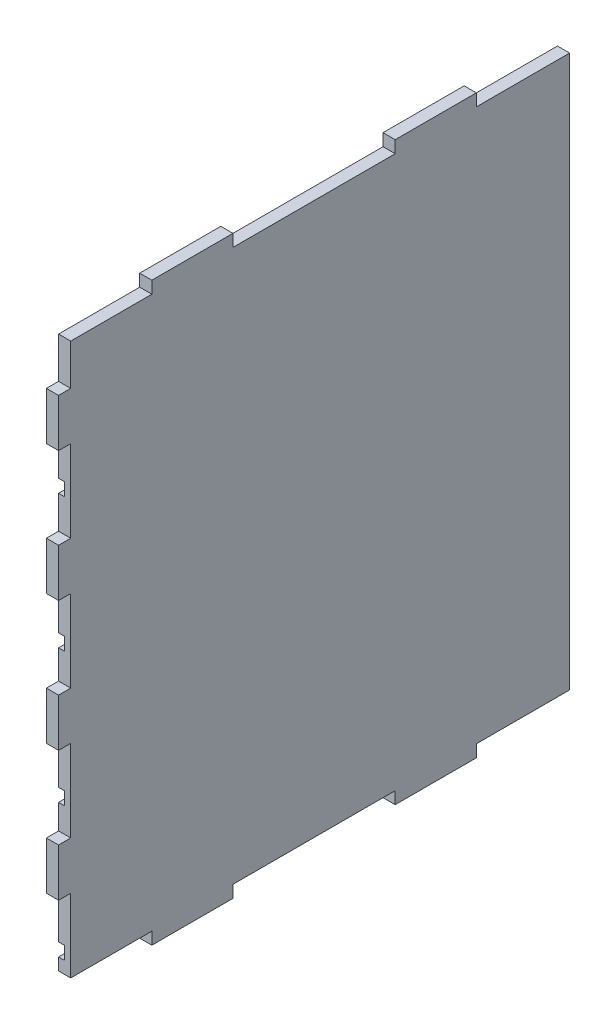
ISO-10303-21;
HEADER;
FILE_DESCRIPTION(('STEP AP214'),'2;1');
FILE_NAME('part.step','',(''),(''),'','','');
FILE_SCHEMA(('AUTOMOTIVE_DESIGN { 1 0 10303 214 1 1 1 1 }'));
ENDSEC;
DATA;
#1=APPLICATION_CONTEXT('core data for automotive mechanical design processes');
#2=APPLICATION_PROTOCOL_DEFINITION('international standard','automotive_design',2000,#1);
#3=PRODUCT_CONTEXT('',#1,'mechanical');
#4=PRODUCT('Part','Part','',(#3));
#5=PRODUCT_RELATED_PRODUCT_CATEGORY('part','',(#4));
#6=PRODUCT_DEFINITION_FORMATION('','',#4);
#7=PRODUCT_DEFINITION_CONTEXT('part definition',#1,'design');
#8=PRODUCT_DEFINITION('design','',#6,#7);
#9=PRODUCT_DEFINITION_SHAPE('','',#8);
#10=(LENGTH_UNIT() NAMED_UNIT(*) SI_UNIT(.MILLI.,.METRE.));
#11=(NAMED_UNIT(*) PLANE_ANGLE_UNIT() SI_UNIT($,.RADIAN.));
#12=(NAMED_UNIT(*) SI_UNIT($,.STERADIAN.) SOLID_ANGLE_UNIT());
#13=UNCERTAINTY_MEASURE_WITH_UNIT(LENGTH_MEASURE(1.E-05),#10,'distance_accuracy_value','');
#14=(GEOMETRIC_REPRESENTATION_CONTEXT(3) GLOBAL_UNCERTAINTY_ASSIGNED_CONTEXT((#13)) GLOBAL_UNIT_ASSIGNED_CONTEXT((#10,
#11,#12)) REPRESENTATION_CONTEXT('',''));
#15=CARTESIAN_POINT('',(0.,0.,0.));
#16=DIRECTION('',(0.,0.,1.));
#17=DIRECTION('',(1.,0.,0.));
#18=AXIS2_PLACEMENT_3D('',#15,#16,#17);
#19=CARTESIAN_POINT('',(0.,0.,630.));
#20=DIRECTION('',(0.,0.,1.));
#21=DIRECTION('',(1.,0.,0.));
#22=AXIS2_PLACEMENT_3D('',#19,#20,#21);
#23=PLANE('',#22);
#24=DIRECTION('',(-1.,0.,0.));
#25=VECTOR('',#24,1.);
#26=CARTESIAN_POINT('',(0.,265.5,630.));
#27=LINE('',#26,#25);
#28=CARTESIAN_POINT('',(0.,265.5,630.));
#29=VERTEX_POINT('',#28);
#30=CARTESIAN_POINT('',(-15.,265.5,630.));
#31=VERTEX_POINT('',#30);
#32=EDGE_CURVE('E411',#29,#31,#27,.T.);
#33=ORIENTED_EDGE('',*,*,#32,.F.);
#34=DIRECTION('',(0.,1.,0.));
#35=VECTOR('',#34,1.);
#36=CARTESIAN_POINT('',(0.,0.,630.));
#37=LINE('',#36,#35);
#38=CARTESIAN_POINT('',(0.,324.5,630.));
#39=VERTEX_POINT('',#38);
#40=EDGE_CURVE('E391',#29,#39,#37,.T.);
#41=ORIENTED_EDGE('',*,*,#40,.T.);
#42=DIRECTION('',(-1.,0.,0.));
#43=VECTOR('',#42,1.);
#44=CARTESIAN_POINT('',(0.,324.5,630.));
#45=LINE('',#44,#43);
#46=CARTESIAN_POINT('',(-15.,324.5,630.));
#47=VERTEX_POINT('',#46);
#48=EDGE_CURVE('E409',#39,#47,#45,.T.);
#49=ORIENTED_EDGE('',*,*,#48,.T.);
#50=DIRECTION('',(0.,-1.,0.));
#51=VECTOR('',#50,1.);
#52=CARTESIAN_POINT('',(-15.,211.,630.));
#53=LINE('',#52,#51);
#54=EDGE_CURVE('E812',#47,#31,#53,.T.);
#55=ORIENTED_EDGE('',*,*,#54,.T.);
#56=EDGE_LOOP('',(#33,#41,#49,#55));
#57=FACE_BOUND('',#56,.T.);
#58=ADVANCED_FACE('F33',(#57),#23,.T.);
#59=DIRECTION('',(-1.,0.,0.));
#60=VECTOR('',#59,1.);
#61=CARTESIAN_POINT('',(0.,425.5,630.));
#62=LINE('',#61,#60);
#63=CARTESIAN_POINT('',(0.,425.5,630.));
#64=VERTEX_POINT('',#63);
#65=CARTESIAN_POINT('',(-15.,425.5,630.));
#66=VERTEX_POINT('',#65);
#67=EDGE_CURVE('E439',#64,#66,#62,.T.);
#68=ORIENTED_EDGE('',*,*,#67,.F.);
#69=CARTESIAN_POINT('',(0.,484.5,630.));
#70=VERTEX_POINT('',#69);
#71=EDGE_CURVE('E387',#64,#70,#37,.T.);
#72=ORIENTED_EDGE('',*,*,#71,.T.);
#73=DIRECTION('',(-1.,0.,0.));
#74=VECTOR('',#73,1.);
#75=CARTESIAN_POINT('',(0.,484.5,630.));
#76=LINE('',#75,#74);
#77=CARTESIAN_POINT('',(-15.,484.5,630.));
#78=VERTEX_POINT('',#77);
#79=EDGE_CURVE('E503',#70,#78,#76,.T.);
#80=ORIENTED_EDGE('',*,*,#79,.T.);
#81=DIRECTION('',(0.,-1.,0.));
#82=VECTOR('',#81,1.);
#83=CARTESIAN_POINT('',(-15.,376.,630.));
#84=LINE('',#83,#82);
#85=EDGE_CURVE('E402',#78,#66,#84,.T.);
#86=ORIENTED_EDGE('',*,*,#85,.T.);
#87=EDGE_LOOP('',(#68,#72,#80,#86));
#88=FACE_BOUND('',#87,.T.);
#89=ADVANCED_FACE('F807',(#88),#23,.T.);
#90=DIRECTION('',(-1.,0.,0.));
#91=VECTOR('',#90,1.);
#92=CARTESIAN_POINT('',(0.,105.5,630.));
#93=LINE('',#92,#91);
#94=CARTESIAN_POINT('',(0.,105.5,630.));
#95=VERTEX_POINT('',#94);
#96=CARTESIAN_POINT('',(-15.,105.5,630.));
#97=VERTEX_POINT('',#96);
#98=EDGE_CURVE('E796',#95,#97,#93,.T.);
#99=ORIENTED_EDGE('',*,*,#98,.F.);
#100=CARTESIAN_POINT('',(0.,164.5,630.));
#101=VERTEX_POINT('',#100);
#102=EDGE_CURVE('E390',#95,#101,#37,.T.);
#103=ORIENTED_EDGE('',*,*,#102,.T.);
#104=DIRECTION('',(-1.,0.,0.));
#105=VECTOR('',#104,1.);
#106=CARTESIAN_POINT('',(0.,164.5,630.));
#107=LINE('',#106,#105);
#108=CARTESIAN_POINT('',(-15.,164.5,630.));
#109=VERTEX_POINT('',#108);
#110=EDGE_CURVE('E459',#101,#109,#107,.T.);
#111=ORIENTED_EDGE('',*,*,#110,.T.);
#112=DIRECTION('',(0.,-1.,0.));
#113=VECTOR('',#112,1.);
#114=CARTESIAN_POINT('',(-15.,46.,630.));
#115=LINE('',#114,#113);
#116=EDGE_CURVE('E658',#109,#97,#115,.T.);
#117=ORIENTED_EDGE('',*,*,#116,.T.);
#118=EDGE_LOOP('',(#99,#103,#111,#117));
#119=FACE_BOUND('',#118,.T.);
#120=ADVANCED_FACE('F815',(#119),#23,.T.);
#121=CARTESIAN_POINT('',(0.,710.,630.));
#122=DIRECTION('',(0.,-1.,0.));
#123=DIRECTION('',(0.,0.,-1.));
#124=AXIS2_PLACEMENT_3D('',#121,#122,#123);
#125=PLANE('',#124);
#126=DIRECTION('',(0.,0.,-1.));
#127=VECTOR('',#126,1.);
#128=CARTESIAN_POINT('',(0.,710.,630.));
#129=LINE('',#128,#127);
#130=CARTESIAN_POINT('',(0.,710.,215.));
#131=VERTEX_POINT('',#130);
#132=CARTESIAN_POINT('',(0.,710.,115.));
#133=VERTEX_POINT('',#132);
#134=EDGE_CURVE('E746',#131,#133,#129,.T.);
#135=ORIENTED_EDGE('',*,*,#134,.T.);
#136=DIRECTION('',(1.,0.,0.));
#137=VECTOR('',#136,1.);
#138=CARTESIAN_POINT('',(-15.0000000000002,710.,115.));
#139=LINE('',#138,#137);
#140=CARTESIAN_POINT('',(-15.0000000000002,710.,115.));
#141=VERTEX_POINT('',#140);
#142=EDGE_CURVE('E582',#141,#133,#139,.T.);
#143=ORIENTED_EDGE('',*,*,#142,.F.);
#144=DIRECTION('',(0.,0.,-1.));
#145=VECTOR('',#144,1.);
#146=CARTESIAN_POINT('',(-15.0000000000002,710.,630.));
#147=LINE('',#146,#145);
#148=CARTESIAN_POINT('',(-15.0000000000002,710.,215.));
#149=VERTEX_POINT('',#148);
#150=EDGE_CURVE('E742',#149,#141,#147,.T.);
#151=ORIENTED_EDGE('',*,*,#150,.F.);
#152=DIRECTION('',(1.,0.,0.));
#153=VECTOR('',#152,1.);
#154=CARTESIAN_POINT('',(-15.0000000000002,710.,215.));
#155=LINE('',#154,#153);
#156=EDGE_CURVE('E609',#149,#131,#155,.T.);
#157=ORIENTED_EDGE('',*,*,#156,.T.);
#158=EDGE_LOOP('',(#135,#143,#151,#157));
#159=FACE_BOUND('',#158,.T.);
#160=ADVANCED_FACE('F900',(#159),#125,.F.);
#161=CARTESIAN_POINT('',(0.,0.,630.));
#162=DIRECTION('',(0.,1.,0.));
#163=DIRECTION('',(-1.,0.,0.));
#164=AXIS2_PLACEMENT_3D('',#161,#162,#163);
#165=PLANE('',#164);
#166=DIRECTION('',(0.,0.,-1.));
#167=VECTOR('',#166,1.);
#168=CARTESIAN_POINT('',(-15.,0.,630.));
#169=LINE('',#168,#167);
#170=CARTESIAN_POINT('',(-15.0000000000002,0.,515.));
#171=VERTEX_POINT('',#170);
#172=CARTESIAN_POINT('',(-15.0000000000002,0.,415.));
#173=VERTEX_POINT('',#172);
#174=EDGE_CURVE('E709',#171,#173,#169,.T.);
#175=ORIENTED_EDGE('',*,*,#174,.T.);
#176=DIRECTION('',(1.,0.,0.));
#177=VECTOR('',#176,1.);
#178=CARTESIAN_POINT('',(-15.0000000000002,0.,415.));
#179=LINE('',#178,#177);
#180=CARTESIAN_POINT('',(0.,0.,415.));
#181=VERTEX_POINT('',#180);
#182=EDGE_CURVE('E541',#173,#181,#179,.T.);
#183=ORIENTED_EDGE('',*,*,#182,.T.);
#184=DIRECTION('',(0.,0.,-1.));
#185=VECTOR('',#184,1.);
#186=CARTESIAN_POINT('',(0.,0.,630.));
#187=LINE('',#186,#185);
#188=CARTESIAN_POINT('',(0.,0.,515.));
#189=VERTEX_POINT('',#188);
#190=EDGE_CURVE('E706',#189,#181,#187,.T.);
#191=ORIENTED_EDGE('',*,*,#190,.F.);
#192=DIRECTION('',(1.,0.,0.));
#193=VECTOR('',#192,1.);
#194=CARTESIAN_POINT('',(-15.0000000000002,0.,515.));
#195=LINE('',#194,#193);
#196=EDGE_CURVE('E557',#171,#189,#195,.T.);
#197=ORIENTED_EDGE('',*,*,#196,.F.);
#198=EDGE_LOOP('',(#175,#183,#191,#197));
#199=FACE_BOUND('',#198,.T.);
#200=ADVANCED_FACE('F898',(#199),#165,.F.);
#201=CARTESIAN_POINT('',(0.,0.,630.));
#202=DIRECTION('',(-1.,0.,0.));
#203=DIRECTION('',(0.,0.,1.));
#204=AXIS2_PLACEMENT_3D('',#201,#202,#203);
#205=PLANE('',#204);
#206=ORIENTED_EDGE('',*,*,#102,.F.);
#207=DIRECTION('',(0.,0.,-1.));
#208=VECTOR('',#207,1.);
#209=CARTESIAN_POINT('',(0.,105.5,630.));
#210=LINE('',#209,#208);
#211=CARTESIAN_POINT('',(0.,105.5,615.));
#212=VERTEX_POINT('',#211);
#213=EDGE_CURVE('E791',#95,#212,#210,.T.);
#214=ORIENTED_EDGE('',*,*,#213,.T.);
#215=DIRECTION('',(0.,-1.,0.));
#216=VECTOR('',#215,1.);
#217=CARTESIAN_POINT('',(0.,105.5,615.));
#218=LINE('',#217,#216);
#219=CARTESIAN_POINT('',(0.,15.,615.));
#220=VERTEX_POINT('',#219);
#221=EDGE_CURVE('E799',#212,#220,#218,.T.);
#222=ORIENTED_EDGE('',*,*,#221,.T.);
#223=DIRECTION('',(0.,0.,1.));
#224=VECTOR('',#223,1.);
#225=CARTESIAN_POINT('',(0.,15.,630.));
#226=LINE('',#225,#224);
#227=CARTESIAN_POINT('',(0.,15.,515.));
#228=VERTEX_POINT('',#227);
#229=EDGE_CURVE('E554',#228,#220,#226,.T.);
#230=ORIENTED_EDGE('',*,*,#229,.F.);
#231=DIRECTION('',(0.,1.,0.));
#232=VECTOR('',#231,1.);
#233=CARTESIAN_POINT('',(0.,15.,515.));
#234=LINE('',#233,#232);
#235=EDGE_CURVE('E558',#189,#228,#234,.T.);
#236=ORIENTED_EDGE('',*,*,#235,.F.);
#237=ORIENTED_EDGE('',*,*,#190,.T.);
#238=DIRECTION('',(0.,-1.,0.));
#239=VECTOR('',#238,1.);
#240=CARTESIAN_POINT('',(0.,15.,415.));
#241=LINE('',#240,#239);
#242=CARTESIAN_POINT('',(0.,15.,415.));
#243=VERTEX_POINT('',#242);
#244=EDGE_CURVE('E526',#243,#181,#241,.T.);
#245=ORIENTED_EDGE('',*,*,#244,.F.);
#246=DIRECTION('',(0.,0.,1.));
#247=VECTOR('',#246,1.);
#248=CARTESIAN_POINT('',(0.,15.,215.));
#249=LINE('',#248,#247);
#250=CARTESIAN_POINT('',(0.,15.,215.));
#251=VERTEX_POINT('',#250);
#252=EDGE_CURVE('E536',#251,#243,#249,.T.);
#253=ORIENTED_EDGE('',*,*,#252,.F.);
#254=DIRECTION('',(0.,1.,0.));
#255=VECTOR('',#254,1.);
#256=CARTESIAN_POINT('',(0.,0.,215.));
#257=LINE('',#256,#255);
#258=CARTESIAN_POINT('',(0.,0.,215.));
#259=VERTEX_POINT('',#258);
#260=EDGE_CURVE('E533',#259,#251,#257,.T.);
#261=ORIENTED_EDGE('',*,*,#260,.F.);
#262=CARTESIAN_POINT('',(0.,0.,115.));
#263=VERTEX_POINT('',#262);
#264=EDGE_CURVE('E704',#259,#263,#187,.T.);
#265=ORIENTED_EDGE('',*,*,#264,.T.);
#266=DIRECTION('',(0.,-1.,0.));
#267=VECTOR('',#266,1.);
#268=CARTESIAN_POINT('',(0.,15.,115.));
#269=LINE('',#268,#267);
#270=CARTESIAN_POINT('',(0.,15.,115.));
#271=VERTEX_POINT('',#270);
#272=EDGE_CURVE('E627',#271,#263,#269,.T.);
#273=ORIENTED_EDGE('',*,*,#272,.F.);
#274=DIRECTION('',(0.,0.,1.));
#275=VECTOR('',#274,1.);
#276=CARTESIAN_POINT('',(0.,15.,0.));
#277=LINE('',#276,#275);
#278=CARTESIAN_POINT('',(0.,15.,0.));
#279=VERTEX_POINT('',#278);
#280=EDGE_CURVE('E544',#279,#271,#277,.T.);
#281=ORIENTED_EDGE('',*,*,#280,.F.);
#282=DIRECTION('',(0.,1.,0.));
#283=VECTOR('',#282,1.);
#284=CARTESIAN_POINT('',(0.,0.,0.));
#285=LINE('',#284,#283);
#286=CARTESIAN_POINT('',(0.,695.,0.));
#287=VERTEX_POINT('',#286);
#288=EDGE_CURVE('E638',#279,#287,#285,.T.);
#289=ORIENTED_EDGE('',*,*,#288,.T.);
#290=DIRECTION('',(0.,0.,-1.));
#291=VECTOR('',#290,1.);
#292=CARTESIAN_POINT('',(0.,695.,0.));
#293=LINE('',#292,#291);
#294=CARTESIAN_POINT('',(0.,695.,115.));
#295=VERTEX_POINT('',#294);
#296=EDGE_CURVE('E574',#295,#287,#293,.T.);
#297=ORIENTED_EDGE('',*,*,#296,.F.);
#298=DIRECTION('',(0.,-1.,0.));
#299=VECTOR('',#298,1.);
#300=CARTESIAN_POINT('',(0.,695.,115.));
#301=LINE('',#300,#299);
#302=EDGE_CURVE('E570',#133,#295,#301,.T.);
#303=ORIENTED_EDGE('',*,*,#302,.F.);
#304=ORIENTED_EDGE('',*,*,#134,.F.);
#305=DIRECTION('',(0.,1.,0.));
#306=VECTOR('',#305,1.);
#307=CARTESIAN_POINT('',(0.,710.,215.));
#308=LINE('',#307,#306);
#309=CARTESIAN_POINT('',(0.,695.,215.));
#310=VERTEX_POINT('',#309);
#311=EDGE_CURVE('E581',#310,#131,#308,.T.);
#312=ORIENTED_EDGE('',*,*,#311,.F.);
#313=DIRECTION('',(0.,0.,-1.));
#314=VECTOR('',#313,1.);
#315=CARTESIAN_POINT('',(0.,695.,215.));
#316=LINE('',#315,#314);
#317=CARTESIAN_POINT('',(0.,695.,415.));
#318=VERTEX_POINT('',#317);
#319=EDGE_CURVE('E603',#318,#310,#316,.T.);
#320=ORIENTED_EDGE('',*,*,#319,.F.);
#321=DIRECTION('',(0.,-1.,0.));
#322=VECTOR('',#321,1.);
#323=CARTESIAN_POINT('',(0.,695.,415.));
#324=LINE('',#323,#322);
#325=CARTESIAN_POINT('',(0.,710.,415.));
#326=VERTEX_POINT('',#325);
#327=EDGE_CURVE('E611',#326,#318,#324,.T.);
#328=ORIENTED_EDGE('',*,*,#327,.F.);
#329=CARTESIAN_POINT('',(0.,710.,515.));
#330=VERTEX_POINT('',#329);
#331=EDGE_CURVE('E749',#330,#326,#129,.T.);
#332=ORIENTED_EDGE('',*,*,#331,.F.);
#333=DIRECTION('',(0.,1.,0.));
#334=VECTOR('',#333,1.);
#335=CARTESIAN_POINT('',(0.,695.,515.));
#336=LINE('',#335,#334);
#337=CARTESIAN_POINT('',(0.,695.,515.));
#338=VERTEX_POINT('',#337);
#339=EDGE_CURVE('E589',#338,#330,#336,.T.);
#340=ORIENTED_EDGE('',*,*,#339,.F.);
#341=DIRECTION('',(0.,0.,-1.));
#342=VECTOR('',#341,1.);
#343=CARTESIAN_POINT('',(0.,695.,630.));
#344=LINE('',#343,#342);
#345=CARTESIAN_POINT('',(0.,695.,615.));
#346=VERTEX_POINT('',#345);
#347=EDGE_CURVE('E521',#346,#338,#344,.T.);
#348=ORIENTED_EDGE('',*,*,#347,.F.);
#349=DIRECTION('',(0.,-1.,0.));
#350=VECTOR('',#349,1.);
#351=CARTESIAN_POINT('',(0.,644.5,615.));
#352=LINE('',#351,#350);
#353=CARTESIAN_POINT('',(0.,644.5,615.));
#354=VERTEX_POINT('',#353);
#355=EDGE_CURVE('E373',#346,#354,#352,.T.);
#356=ORIENTED_EDGE('',*,*,#355,.T.);
#357=DIRECTION('',(0.,0.,1.));
#358=VECTOR('',#357,1.);
#359=CARTESIAN_POINT('',(0.,644.5,630.));
#360=LINE('',#359,#358);
#361=CARTESIAN_POINT('',(0.,644.5,630.));
#362=VERTEX_POINT('',#361);
#363=EDGE_CURVE('E365',#354,#362,#360,.T.);
#364=ORIENTED_EDGE('',*,*,#363,.T.);
#365=CARTESIAN_POINT('',(0.,585.5,630.));
#366=VERTEX_POINT('',#365);
#367=EDGE_CURVE('E379',#366,#362,#37,.T.);
#368=ORIENTED_EDGE('',*,*,#367,.F.);
#369=DIRECTION('',(0.,0.,-1.));
#370=VECTOR('',#369,1.);
#371=CARTESIAN_POINT('',(0.,585.5,630.));
#372=LINE('',#371,#370);
#373=CARTESIAN_POINT('',(0.,585.5,615.));
#374=VERTEX_POINT('',#373);
#375=EDGE_CURVE('E488',#366,#374,#372,.T.);
#376=ORIENTED_EDGE('',*,*,#375,.T.);
#377=DIRECTION('',(0.,-1.,0.));
#378=VECTOR('',#377,1.);
#379=CARTESIAN_POINT('',(0.,585.5,615.));
#380=LINE('',#379,#378);
#381=CARTESIAN_POINT('',(0.,484.5,615.));
#382=VERTEX_POINT('',#381);
#383=EDGE_CURVE('E490',#374,#382,#380,.T.);
#384=ORIENTED_EDGE('',*,*,#383,.T.);
#385=DIRECTION('',(0.,0.,1.));
#386=VECTOR('',#385,1.);
#387=CARTESIAN_POINT('',(0.,484.5,630.));
#388=LINE('',#387,#386);
#389=EDGE_CURVE('E494',#382,#70,#388,.T.);
#390=ORIENTED_EDGE('',*,*,#389,.T.);
#391=ORIENTED_EDGE('',*,*,#71,.F.);
#392=DIRECTION('',(0.,0.,-1.));
#393=VECTOR('',#392,1.);
#394=CARTESIAN_POINT('',(0.,425.5,630.));
#395=LINE('',#394,#393);
#396=CARTESIAN_POINT('',(0.,425.5,615.));
#397=VERTEX_POINT('',#396);
#398=EDGE_CURVE('E428',#64,#397,#395,.T.);
#399=ORIENTED_EDGE('',*,*,#398,.T.);
#400=DIRECTION('',(0.,-1.,0.));
#401=VECTOR('',#400,1.);
#402=CARTESIAN_POINT('',(0.,425.5,615.));
#403=LINE('',#402,#401);
#404=CARTESIAN_POINT('',(0.,324.5,615.));
#405=VERTEX_POINT('',#404);
#406=EDGE_CURVE('E421',#397,#405,#403,.T.);
#407=ORIENTED_EDGE('',*,*,#406,.T.);
#408=DIRECTION('',(0.,0.,1.));
#409=VECTOR('',#408,1.);
#410=CARTESIAN_POINT('',(0.,324.5,630.));
#411=LINE('',#410,#409);
#412=EDGE_CURVE('E418',#405,#39,#411,.T.);
#413=ORIENTED_EDGE('',*,*,#412,.T.);
#414=ORIENTED_EDGE('',*,*,#40,.F.);
#415=DIRECTION('',(0.,0.,-1.));
#416=VECTOR('',#415,1.);
#417=CARTESIAN_POINT('',(0.,265.5,630.));
#418=LINE('',#417,#416);
#419=CARTESIAN_POINT('',(0.,265.5,615.));
#420=VERTEX_POINT('',#419);
#421=EDGE_CURVE('E415',#29,#420,#418,.T.);
#422=ORIENTED_EDGE('',*,*,#421,.T.);
#423=DIRECTION('',(0.,-1.,0.));
#424=VECTOR('',#423,1.);
#425=CARTESIAN_POINT('',(0.,265.5,615.));
#426=LINE('',#425,#424);
#427=CARTESIAN_POINT('',(0.,164.5,615.));
#428=VERTEX_POINT('',#427);
#429=EDGE_CURVE('E445',#420,#428,#426,.T.);
#430=ORIENTED_EDGE('',*,*,#429,.T.);
#431=DIRECTION('',(0.,0.,1.));
#432=VECTOR('',#431,1.);
#433=CARTESIAN_POINT('',(0.,164.5,630.));
#434=LINE('',#433,#432);
#435=EDGE_CURVE('E448',#428,#101,#434,.T.);
#436=ORIENTED_EDGE('',*,*,#435,.T.);
#437=EDGE_LOOP('',(#206,#214,#222,#230,#236,#237,#245,#253,#261,#265,#273,#281,#289,#297,#303,
#304,#312,#320,#328,#332,#340,#348,#356,#364,#368,#376,#384,#390,#391,#399,#407,#413,#414,#422,
#430,#436));
#438=FACE_BOUND('',#437,.T.);
#439=ADVANCED_FACE('F35',(#438),#205,.F.);
#440=CARTESIAN_POINT('',(-15.0000000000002,710.,515.));
#441=VERTEX_POINT('',#440);
#442=CARTESIAN_POINT('',(-15.0000000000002,710.,415.));
#443=VERTEX_POINT('',#442);
#444=EDGE_CURVE('E745',#441,#443,#147,.T.);
#445=ORIENTED_EDGE('',*,*,#444,.F.);
#446=DIRECTION('',(1.,0.,0.));
#447=VECTOR('',#446,1.);
#448=CARTESIAN_POINT('',(-15.0000000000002,710.,515.));
#449=LINE('',#448,#447);
#450=EDGE_CURVE('E576',#441,#330,#449,.T.);
#451=ORIENTED_EDGE('',*,*,#450,.T.);
#452=ORIENTED_EDGE('',*,*,#331,.T.);
#453=DIRECTION('',(1.,0.,0.));
#454=VECTOR('',#453,1.);
#455=CARTESIAN_POINT('',(-15.0000000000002,710.,415.));
#456=LINE('',#455,#454);
#457=EDGE_CURVE('E619',#443,#326,#456,.T.);
#458=ORIENTED_EDGE('',*,*,#457,.F.);
#459=EDGE_LOOP('',(#445,#451,#452,#458));
#460=FACE_BOUND('',#459,.T.);
#461=ADVANCED_FACE('F905',(#460),#125,.F.);
#462=CARTESIAN_POINT('',(-15.,541.,630.));
#463=DIRECTION('',(1.,0.,0.));
#464=DIRECTION('',(0.,1.,0.));
#465=AXIS2_PLACEMENT_3D('',#462,#463,#464);
#466=PLANE('',#465);
#467=DIRECTION('',(0.,-1.,0.));
#468=VECTOR('',#467,1.);
#469=CARTESIAN_POINT('',(-15.,541.,630.));
#470=LINE('',#469,#468);
#471=CARTESIAN_POINT('',(-15.,644.5,630.));
#472=VERTEX_POINT('',#471);
#473=CARTESIAN_POINT('',(-15.,585.5,630.));
#474=VERTEX_POINT('',#473);
#475=EDGE_CURVE('E398',#472,#474,#470,.T.);
#476=ORIENTED_EDGE('',*,*,#475,.F.);
#477=DIRECTION('',(0.,0.,1.));
#478=VECTOR('',#477,1.);
#479=CARTESIAN_POINT('',(-15.,644.5,630.));
#480=LINE('',#479,#478);
#481=CARTESIAN_POINT('',(-15.,644.5,615.));
#482=VERTEX_POINT('',#481);
#483=EDGE_CURVE('E368',#482,#472,#480,.T.);
#484=ORIENTED_EDGE('',*,*,#483,.F.);
#485=DIRECTION('',(0.,-1.,0.));
#486=VECTOR('',#485,1.);
#487=CARTESIAN_POINT('',(-15.,644.5,615.));
#488=LINE('',#487,#486);
#489=CARTESIAN_POINT('',(-15.,695.,615.));
#490=VERTEX_POINT('',#489);
#491=EDGE_CURVE('E381',#490,#482,#488,.T.);
#492=ORIENTED_EDGE('',*,*,#491,.F.);
#493=DIRECTION('',(0.,0.,-1.));
#494=VECTOR('',#493,1.);
#495=CARTESIAN_POINT('',(-15.0000000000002,695.,630.));
#496=LINE('',#495,#494);
#497=CARTESIAN_POINT('',(-15.0000000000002,695.,515.));
#498=VERTEX_POINT('',#497);
#499=EDGE_CURVE('E586',#490,#498,#496,.T.);
#500=ORIENTED_EDGE('',*,*,#499,.T.);
#501=DIRECTION('',(0.,1.,0.));
#502=VECTOR('',#501,1.);
#503=CARTESIAN_POINT('',(-15.0000000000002,695.,515.));
#504=LINE('',#503,#502);
#505=EDGE_CURVE('E588',#498,#441,#504,.T.);
#506=ORIENTED_EDGE('',*,*,#505,.T.);
#507=ORIENTED_EDGE('',*,*,#444,.T.);
#508=DIRECTION('',(0.,-1.,0.));
#509=VECTOR('',#508,1.);
#510=CARTESIAN_POINT('',(-15.0000000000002,695.,415.));
#511=LINE('',#510,#509);
#512=CARTESIAN_POINT('',(-15.0000000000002,695.,415.));
#513=VERTEX_POINT('',#512);
#514=EDGE_CURVE('E602',#443,#513,#511,.T.);
#515=ORIENTED_EDGE('',*,*,#514,.T.);
#516=DIRECTION('',(0.,0.,-1.));
#517=VECTOR('',#516,1.);
#518=CARTESIAN_POINT('',(-15.0000000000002,695.,215.));
#519=LINE('',#518,#517);
#520=CARTESIAN_POINT('',(-15.0000000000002,695.,215.));
#521=VERTEX_POINT('',#520);
#522=EDGE_CURVE('E606',#513,#521,#519,.T.);
#523=ORIENTED_EDGE('',*,*,#522,.T.);
#524=DIRECTION('',(0.,1.,0.));
#525=VECTOR('',#524,1.);
#526=CARTESIAN_POINT('',(-15.0000000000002,710.,215.));
#527=LINE('',#526,#525);
#528=EDGE_CURVE('E599',#521,#149,#527,.T.);
#529=ORIENTED_EDGE('',*,*,#528,.T.);
#530=ORIENTED_EDGE('',*,*,#150,.T.);
#531=DIRECTION('',(0.,-1.,0.));
#532=VECTOR('',#531,1.);
#533=CARTESIAN_POINT('',(-15.0000000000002,695.,115.));
#534=LINE('',#533,#532);
#535=CARTESIAN_POINT('',(-15.0000000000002,695.,115.));
#536=VERTEX_POINT('',#535);
#537=EDGE_CURVE('E569',#141,#536,#534,.T.);
#538=ORIENTED_EDGE('',*,*,#537,.T.);
#539=DIRECTION('',(0.,0.,-1.));
#540=VECTOR('',#539,1.);
#541=CARTESIAN_POINT('',(-15.0000000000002,695.,0.));
#542=LINE('',#541,#540);
#543=CARTESIAN_POINT('',(-15.0000000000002,695.,0.));
#544=VERTEX_POINT('',#543);
#545=EDGE_CURVE('E566',#536,#544,#542,.T.);
#546=ORIENTED_EDGE('',*,*,#545,.T.);
#547=DIRECTION('',(0.,-1.,0.));
#548=VECTOR('',#547,1.);
#549=CARTESIAN_POINT('',(-15.,541.,0.));
#550=LINE('',#549,#548);
#551=CARTESIAN_POINT('',(-15.,541.,0.));
#552=VERTEX_POINT('',#551);
#553=EDGE_CURVE('E652',#544,#552,#550,.T.);
#554=ORIENTED_EDGE('',*,*,#553,.T.);
#555=DIRECTION('',(0.,0.,-1.));
#556=VECTOR('',#555,1.);
#557=CARTESIAN_POINT('',(-15.,541.,630.));
#558=LINE('',#557,#556);
#559=CARTESIAN_POINT('',(-15.,541.,615.));
#560=VERTEX_POINT('',#559);
#561=EDGE_CURVE('E740',#560,#552,#558,.T.);
#562=ORIENTED_EDGE('',*,*,#561,.F.);
#563=DIRECTION('',(0.,-1.,0.));
#564=VECTOR('',#563,1.);
#565=CARTESIAN_POINT('',(-15.,585.5,615.));
#566=LINE('',#565,#564);
#567=CARTESIAN_POINT('',(-15.,585.5,615.));
#568=VERTEX_POINT('',#567);
#569=EDGE_CURVE('E500',#568,#560,#566,.T.);
#570=ORIENTED_EDGE('',*,*,#569,.F.);
#571=DIRECTION('',(0.,0.,-1.));
#572=VECTOR('',#571,1.);
#573=CARTESIAN_POINT('',(-15.,585.5,630.));
#574=LINE('',#573,#572);
#575=EDGE_CURVE('E487',#474,#568,#574,.T.);
#576=ORIENTED_EDGE('',*,*,#575,.F.);
#577=EDGE_LOOP('',(#476,#484,#492,#500,#506,#507,#515,#523,#529,#530,#538,#546,#554,#562,#570,#576));
#578=FACE_BOUND('',#577,.T.);
#579=ADVANCED_FACE('F831',(#578),#466,.F.);
#580=CARTESIAN_POINT('',(-7.50000000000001,541.,630.));
#581=DIRECTION('',(0.,1.,0.));
#582=DIRECTION('',(0.,0.,1.));
#583=AXIS2_PLACEMENT_3D('',#580,#581,#582);
#584=PLANE('',#583);
#585=DIRECTION('',(0.,0.,-1.));
#586=VECTOR('',#585,1.);
#587=CARTESIAN_POINT('',(-7.50000000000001,541.,630.));
#588=LINE('',#587,#586);
#589=CARTESIAN_POINT('',(-7.50000000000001,541.,615.));
#590=VERTEX_POINT('',#589);
#591=CARTESIAN_POINT('',(-7.50000000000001,541.,0.));
#592=VERTEX_POINT('',#591);
#593=EDGE_CURVE('E738',#590,#592,#588,.T.);
#594=ORIENTED_EDGE('',*,*,#593,.F.);
#595=DIRECTION('',(-1.,0.,0.));
#596=VECTOR('',#595,1.);
#597=CARTESIAN_POINT('',(-7.50000000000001,541.,615.));
#598=LINE('',#597,#596);
#599=EDGE_CURVE('E518',#590,#560,#598,.T.);
#600=ORIENTED_EDGE('',*,*,#599,.T.);
#601=ORIENTED_EDGE('',*,*,#561,.T.);
#602=DIRECTION('',(1.,0.,0.));
#603=VECTOR('',#602,1.);
#604=CARTESIAN_POINT('',(-7.50000000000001,541.,0.));
#605=LINE('',#604,#603);
#606=EDGE_CURVE('E655',#552,#592,#605,.T.);
#607=ORIENTED_EDGE('',*,*,#606,.T.);
#608=EDGE_LOOP('',(#594,#600,#601,#607));
#609=FACE_BOUND('',#608,.T.);
#610=ADVANCED_FACE('F917',(#609),#584,.F.);
#611=CARTESIAN_POINT('',(-7.5,525.,630.));
#612=DIRECTION('',(1.,0.,0.));
#613=DIRECTION('',(0.,1.,0.));
#614=AXIS2_PLACEMENT_3D('',#611,#612,#613);
#615=PLANE('',#614);
#616=DIRECTION('',(0.,0.,-1.));
#617=VECTOR('',#616,1.);
#618=CARTESIAN_POINT('',(-7.5,525.,630.));
#619=LINE('',#618,#617);
#620=CARTESIAN_POINT('',(-7.5,525.,615.));
#621=VERTEX_POINT('',#620);
#622=CARTESIAN_POINT('',(-7.5,525.,0.));
#623=VERTEX_POINT('',#622);
#624=EDGE_CURVE('E736',#621,#623,#619,.T.);
#625=ORIENTED_EDGE('',*,*,#624,.F.);
#626=DIRECTION('',(0.,1.,0.));
#627=VECTOR('',#626,1.);
#628=CARTESIAN_POINT('',(-7.5,525.,615.));
#629=LINE('',#628,#627);
#630=EDGE_CURVE('E515',#621,#590,#629,.T.);
#631=ORIENTED_EDGE('',*,*,#630,.T.);
#632=ORIENTED_EDGE('',*,*,#593,.T.);
#633=DIRECTION('',(0.,-1.,0.));
#634=VECTOR('',#633,1.);
#635=CARTESIAN_POINT('',(-7.5,525.,0.));
#636=LINE('',#635,#634);
#637=EDGE_CURVE('E663',#592,#623,#636,.T.);
#638=ORIENTED_EDGE('',*,*,#637,.T.);
#639=EDGE_LOOP('',(#625,#631,#632,#638));
#640=FACE_BOUND('',#639,.T.);
#641=ADVANCED_FACE('F952',(#640),#615,.F.);
#642=CARTESIAN_POINT('',(-15.,525.,630.));
#643=DIRECTION('',(0.,-1.,0.));
#644=DIRECTION('',(0.,0.,-1.));
#645=AXIS2_PLACEMENT_3D('',#642,#643,#644);
#646=PLANE('',#645);
#647=DIRECTION('',(0.,0.,-1.));
#648=VECTOR('',#647,1.);
#649=CARTESIAN_POINT('',(-15.,525.,630.));
#650=LINE('',#649,#648);
#651=CARTESIAN_POINT('',(-15.,525.,615.));
#652=VERTEX_POINT('',#651);
#653=CARTESIAN_POINT('',(-15.,525.,0.));
#654=VERTEX_POINT('',#653);
#655=EDGE_CURVE('E734',#652,#654,#650,.T.);
#656=ORIENTED_EDGE('',*,*,#655,.F.);
#657=DIRECTION('',(1.,0.,0.));
#658=VECTOR('',#657,1.);
#659=CARTESIAN_POINT('',(-15.,525.,615.));
#660=LINE('',#659,#658);
#661=EDGE_CURVE('E506',#652,#621,#660,.T.);
#662=ORIENTED_EDGE('',*,*,#661,.T.);
#663=ORIENTED_EDGE('',*,*,#624,.T.);
#664=DIRECTION('',(-1.,0.,0.));
#665=VECTOR('',#664,1.);
#666=CARTESIAN_POINT('',(-15.,525.,0.));
#667=LINE('',#666,#665);
#668=EDGE_CURVE('E666',#623,#654,#667,.T.);
#669=ORIENTED_EDGE('',*,*,#668,.T.);
#670=EDGE_LOOP('',(#656,#662,#663,#669));
#671=FACE_BOUND('',#670,.T.);
#672=ADVANCED_FACE('F847',(#671),#646,.F.);
#673=CARTESIAN_POINT('',(-15.,376.,630.));
#674=DIRECTION('',(1.,0.,0.));
#675=DIRECTION('',(0.,0.,-1.));
#676=AXIS2_PLACEMENT_3D('',#673,#674,#675);
#677=PLANE('',#676);
#678=DIRECTION('',(0.,-1.,0.));
#679=VECTOR('',#678,1.);
#680=CARTESIAN_POINT('',(-15.,425.5,615.));
#681=LINE('',#680,#679);
#682=CARTESIAN_POINT('',(-15.,425.5,615.));
#683=VERTEX_POINT('',#682);
#684=CARTESIAN_POINT('',(-15.,376.,615.));
#685=VERTEX_POINT('',#684);
#686=EDGE_CURVE('E435',#683,#685,#681,.T.);
#687=ORIENTED_EDGE('',*,*,#686,.F.);
#688=DIRECTION('',(0.,0.,-1.));
#689=VECTOR('',#688,1.);
#690=CARTESIAN_POINT('',(-15.,425.5,630.));
#691=LINE('',#690,#689);
#692=EDGE_CURVE('E432',#66,#683,#691,.T.);
#693=ORIENTED_EDGE('',*,*,#692,.F.);
#694=ORIENTED_EDGE('',*,*,#85,.F.);
#695=DIRECTION('',(0.,0.,1.));
#696=VECTOR('',#695,1.);
#697=CARTESIAN_POINT('',(-15.,484.5,630.));
#698=LINE('',#697,#696);
#699=CARTESIAN_POINT('',(-15.,484.5,615.));
#700=VERTEX_POINT('',#699);
#701=EDGE_CURVE('E491',#700,#78,#698,.T.);
#702=ORIENTED_EDGE('',*,*,#701,.F.);
#703=EDGE_CURVE('E499',#652,#700,#566,.T.);
#704=ORIENTED_EDGE('',*,*,#703,.F.);
#705=ORIENTED_EDGE('',*,*,#655,.T.);
#706=DIRECTION('',(0.,-1.,0.));
#707=VECTOR('',#706,1.);
#708=CARTESIAN_POINT('',(-15.,376.,0.));
#709=LINE('',#708,#707);
#710=CARTESIAN_POINT('',(-15.,376.,0.));
#711=VERTEX_POINT('',#710);
#712=EDGE_CURVE('E669',#654,#711,#709,.T.);
#713=ORIENTED_EDGE('',*,*,#712,.T.);
#714=DIRECTION('',(0.,0.,-1.));
#715=VECTOR('',#714,1.);
#716=CARTESIAN_POINT('',(-15.,376.,630.));
#717=LINE('',#716,#715);
#718=EDGE_CURVE('E732',#685,#711,#717,.T.);
#719=ORIENTED_EDGE('',*,*,#718,.F.);
#720=EDGE_LOOP('',(#687,#693,#694,#702,#704,#705,#713,#719));
#721=FACE_BOUND('',#720,.T.);
#722=ADVANCED_FACE('F844',(#721),#677,.F.);
#723=CARTESIAN_POINT('',(-7.50000000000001,376.,630.));
#724=DIRECTION('',(0.,1.,0.));
#725=DIRECTION('',(-1.,0.,0.));
#726=AXIS2_PLACEMENT_3D('',#723,#724,#725);
#727=PLANE('',#726);
#728=DIRECTION('',(0.,0.,-1.));
#729=VECTOR('',#728,1.);
#730=CARTESIAN_POINT('',(-7.50000000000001,376.,630.));
#731=LINE('',#730,#729);
#732=CARTESIAN_POINT('',(-7.50000000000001,376.,615.));
#733=VERTEX_POINT('',#732);
#734=CARTESIAN_POINT('',(-7.50000000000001,376.,0.));
#735=VERTEX_POINT('',#734);
#736=EDGE_CURVE('E730',#733,#735,#731,.T.);
#737=ORIENTED_EDGE('',*,*,#736,.F.);
#738=DIRECTION('',(-1.,0.,0.));
#739=VECTOR('',#738,1.);
#740=CARTESIAN_POINT('',(-7.50000000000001,376.,615.));
#741=LINE('',#740,#739);
#742=EDGE_CURVE('E484',#733,#685,#741,.T.);
#743=ORIENTED_EDGE('',*,*,#742,.T.);
#744=ORIENTED_EDGE('',*,*,#718,.T.);
#745=DIRECTION('',(1.,0.,0.));
#746=VECTOR('',#745,1.);
#747=CARTESIAN_POINT('',(-7.50000000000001,376.,0.));
#748=LINE('',#747,#746);
#749=EDGE_CURVE('E672',#711,#735,#748,.T.);
#750=ORIENTED_EDGE('',*,*,#749,.T.);
#751=EDGE_LOOP('',(#737,#743,#744,#750));
#752=FACE_BOUND('',#751,.T.);
#753=ADVANCED_FACE('F857',(#752),#727,.F.);
#754=CARTESIAN_POINT('',(-7.5,360.,630.));
#755=DIRECTION('',(1.,0.,0.));
#756=DIRECTION('',(0.,1.,0.));
#757=AXIS2_PLACEMENT_3D('',#754,#755,#756);
#758=PLANE('',#757);
#759=DIRECTION('',(0.,0.,-1.));
#760=VECTOR('',#759,1.);
#761=CARTESIAN_POINT('',(-7.5,360.,630.));
#762=LINE('',#761,#760);
#763=CARTESIAN_POINT('',(-7.5,360.,615.));
#764=VERTEX_POINT('',#763);
#765=CARTESIAN_POINT('',(-7.5,360.,0.));
#766=VERTEX_POINT('',#765);
#767=EDGE_CURVE('E728',#764,#766,#762,.T.);
#768=ORIENTED_EDGE('',*,*,#767,.F.);
#769=DIRECTION('',(0.,1.,0.));
#770=VECTOR('',#769,1.);
#771=CARTESIAN_POINT('',(-7.5,360.,615.));
#772=LINE('',#771,#770);
#773=EDGE_CURVE('E481',#764,#733,#772,.T.);
#774=ORIENTED_EDGE('',*,*,#773,.T.);
#775=ORIENTED_EDGE('',*,*,#736,.T.);
#776=DIRECTION('',(0.,-1.,0.));
#777=VECTOR('',#776,1.);
#778=CARTESIAN_POINT('',(-7.5,360.,0.));
#779=LINE('',#778,#777);
#780=EDGE_CURVE('E675',#735,#766,#779,.T.);
#781=ORIENTED_EDGE('',*,*,#780,.T.);
#782=EDGE_LOOP('',(#768,#774,#775,#781));
#783=FACE_BOUND('',#782,.T.);
#784=ADVANCED_FACE('F861',(#783),#758,.F.);
#785=CARTESIAN_POINT('',(-15.,360.,630.));
#786=DIRECTION('',(0.,-1.,0.));
#787=DIRECTION('',(1.,0.,0.));
#788=AXIS2_PLACEMENT_3D('',#785,#786,#787);
#789=PLANE('',#788);
#790=DIRECTION('',(0.,0.,-1.));
#791=VECTOR('',#790,1.);
#792=CARTESIAN_POINT('',(-15.,360.,630.));
#793=LINE('',#792,#791);
#794=CARTESIAN_POINT('',(-15.,360.,615.));
#795=VERTEX_POINT('',#794);
#796=CARTESIAN_POINT('',(-15.,360.,0.));
#797=VERTEX_POINT('',#796);
#798=EDGE_CURVE('E726',#795,#797,#793,.T.);
#799=ORIENTED_EDGE('',*,*,#798,.F.);
#800=DIRECTION('',(1.,0.,0.));
#801=VECTOR('',#800,1.);
#802=CARTESIAN_POINT('',(-15.,360.,615.));
#803=LINE('',#802,#801);
#804=EDGE_CURVE('E48',#795,#764,#803,.T.);
#805=ORIENTED_EDGE('',*,*,#804,.T.);
#806=ORIENTED_EDGE('',*,*,#767,.T.);
#807=DIRECTION('',(-1.,0.,0.));
#808=VECTOR('',#807,1.);
#809=CARTESIAN_POINT('',(-15.,360.,0.));
#810=LINE('',#809,#808);
#811=EDGE_CURVE('E678',#766,#797,#810,.T.);
#812=ORIENTED_EDGE('',*,*,#811,.T.);
#813=EDGE_LOOP('',(#799,#805,#806,#812));
#814=FACE_BOUND('',#813,.T.);
#815=ADVANCED_FACE('F865',(#814),#789,.F.);
#816=CARTESIAN_POINT('',(-15.,211.,630.));
#817=DIRECTION('',(1.,0.,0.));
#818=DIRECTION('',(0.,0.,-1.));
#819=AXIS2_PLACEMENT_3D('',#816,#817,#818);
#820=PLANE('',#819);
#821=DIRECTION('',(0.,-1.,0.));
#822=VECTOR('',#821,1.);
#823=CARTESIAN_POINT('',(-15.,265.5,615.));
#824=LINE('',#823,#822);
#825=CARTESIAN_POINT('',(-15.,265.5,615.));
#826=VERTEX_POINT('',#825);
#827=CARTESIAN_POINT('',(-15.,211.,615.));
#828=VERTEX_POINT('',#827);
#829=EDGE_CURVE('E455',#826,#828,#824,.T.);
#830=ORIENTED_EDGE('',*,*,#829,.F.);
#831=DIRECTION('',(0.,0.,-1.));
#832=VECTOR('',#831,1.);
#833=CARTESIAN_POINT('',(-15.,265.5,630.));
#834=LINE('',#833,#832);
#835=EDGE_CURVE('E452',#31,#826,#834,.T.);
#836=ORIENTED_EDGE('',*,*,#835,.F.);
#837=ORIENTED_EDGE('',*,*,#54,.F.);
#838=DIRECTION('',(0.,0.,1.));
#839=VECTOR('',#838,1.);
#840=CARTESIAN_POINT('',(-15.,324.5,630.));
#841=LINE('',#840,#839);
#842=CARTESIAN_POINT('',(-15.,324.5,615.));
#843=VERTEX_POINT('',#842);
#844=EDGE_CURVE('E437',#843,#47,#841,.T.);
#845=ORIENTED_EDGE('',*,*,#844,.F.);
#846=DIRECTION('',(0.,1.,0.));
#847=VECTOR('',#846,1.);
#848=CARTESIAN_POINT('',(-15.,211.,615.));
#849=LINE('',#848,#847);
#850=EDGE_CURVE('E11',#843,#795,#849,.T.);
#851=ORIENTED_EDGE('',*,*,#850,.T.);
#852=ORIENTED_EDGE('',*,*,#798,.T.);
#853=DIRECTION('',(0.,-1.,0.));
#854=VECTOR('',#853,1.);
#855=CARTESIAN_POINT('',(-15.,211.,0.));
#856=LINE('',#855,#854);
#857=CARTESIAN_POINT('',(-15.,211.,0.));
#858=VERTEX_POINT('',#857);
#859=EDGE_CURVE('E681',#797,#858,#856,.T.);
#860=ORIENTED_EDGE('',*,*,#859,.T.);
#861=DIRECTION('',(0.,0.,-1.));
#862=VECTOR('',#861,1.);
#863=CARTESIAN_POINT('',(-15.,211.,630.));
#864=LINE('',#863,#862);
#865=EDGE_CURVE('E724',#828,#858,#864,.T.);
#866=ORIENTED_EDGE('',*,*,#865,.F.);
#867=EDGE_LOOP('',(#830,#836,#837,#845,#851,#852,#860,#866));
#868=FACE_BOUND('',#867,.T.);
#869=ADVANCED_FACE('F869',(#868),#820,.F.);
#870=CARTESIAN_POINT('',(-7.50000000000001,211.,630.));
#871=DIRECTION('',(0.,1.,0.));
#872=DIRECTION('',(0.,0.,1.));
#873=AXIS2_PLACEMENT_3D('',#870,#871,#872);
#874=PLANE('',#873);
#875=DIRECTION('',(0.,0.,-1.));
#876=VECTOR('',#875,1.);
#877=CARTESIAN_POINT('',(-7.50000000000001,211.,630.));
#878=LINE('',#877,#876);
#879=CARTESIAN_POINT('',(-7.50000000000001,211.,615.));
#880=VERTEX_POINT('',#879);
#881=CARTESIAN_POINT('',(-7.50000000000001,211.,0.));
#882=VERTEX_POINT('',#881);
#883=EDGE_CURVE('E722',#880,#882,#878,.T.);
#884=ORIENTED_EDGE('',*,*,#883,.F.);
#885=DIRECTION('',(-1.,0.,0.));
#886=VECTOR('',#885,1.);
#887=CARTESIAN_POINT('',(-7.50000000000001,211.,615.));
#888=LINE('',#887,#886);
#889=EDGE_CURVE('E477',#880,#828,#888,.T.);
#890=ORIENTED_EDGE('',*,*,#889,.T.);
#891=ORIENTED_EDGE('',*,*,#865,.T.);
#892=DIRECTION('',(1.,0.,0.));
#893=VECTOR('',#892,1.);
#894=CARTESIAN_POINT('',(-7.50000000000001,211.,0.));
#895=LINE('',#894,#893);
#896=EDGE_CURVE('E684',#858,#882,#895,.T.);
#897=ORIENTED_EDGE('',*,*,#896,.T.);
#898=EDGE_LOOP('',(#884,#890,#891,#897));
#899=FACE_BOUND('',#898,.T.);
#900=ADVANCED_FACE('F972',(#899),#874,.F.);
#901=CARTESIAN_POINT('',(-7.5,195.,630.));
#902=DIRECTION('',(1.,0.,0.));
#903=DIRECTION('',(0.,1.,0.));
#904=AXIS2_PLACEMENT_3D('',#901,#902,#903);
#905=PLANE('',#904);
#906=DIRECTION('',(0.,0.,-1.));
#907=VECTOR('',#906,1.);
#908=CARTESIAN_POINT('',(-7.5,195.,630.));
#909=LINE('',#908,#907);
#910=CARTESIAN_POINT('',(-7.5,195.,615.));
#911=VERTEX_POINT('',#910);
#912=CARTESIAN_POINT('',(-7.5,195.,0.));
#913=VERTEX_POINT('',#912);
#914=EDGE_CURVE('E720',#911,#913,#909,.T.);
#915=ORIENTED_EDGE('',*,*,#914,.F.);
#916=DIRECTION('',(0.,1.,0.));
#917=VECTOR('',#916,1.);
#918=CARTESIAN_POINT('',(-7.5,195.,615.));
#919=LINE('',#918,#917);
#920=EDGE_CURVE('E474',#911,#880,#919,.T.);
#921=ORIENTED_EDGE('',*,*,#920,.T.);
#922=ORIENTED_EDGE('',*,*,#883,.T.);
#923=DIRECTION('',(0.,-1.,0.));
#924=VECTOR('',#923,1.);
#925=CARTESIAN_POINT('',(-7.5,195.,0.));
#926=LINE('',#925,#924);
#927=EDGE_CURVE('E687',#882,#913,#926,.T.);
#928=ORIENTED_EDGE('',*,*,#927,.T.);
#929=EDGE_LOOP('',(#915,#921,#922,#928));
#930=FACE_BOUND('',#929,.T.);
#931=ADVANCED_FACE('F975',(#930),#905,.F.);
#932=CARTESIAN_POINT('',(-15.,195.,630.));
#933=DIRECTION('',(0.,-1.,0.));
#934=DIRECTION('',(1.,0.,0.));
#935=AXIS2_PLACEMENT_3D('',#932,#933,#934);
#936=PLANE('',#935);
#937=DIRECTION('',(0.,0.,-1.));
#938=VECTOR('',#937,1.);
#939=CARTESIAN_POINT('',(-15.,195.,630.));
#940=LINE('',#939,#938);
#941=CARTESIAN_POINT('',(-15.,195.,615.));
#942=VERTEX_POINT('',#941);
#943=CARTESIAN_POINT('',(-15.,195.,0.));
#944=VERTEX_POINT('',#943);
#945=EDGE_CURVE('E718',#942,#944,#940,.T.);
#946=ORIENTED_EDGE('',*,*,#945,.F.);
#947=DIRECTION('',(1.,0.,0.));
#948=VECTOR('',#947,1.);
#949=CARTESIAN_POINT('',(-15.,195.,615.));
#950=LINE('',#949,#948);
#951=EDGE_CURVE('E55',#942,#911,#950,.T.);
#952=ORIENTED_EDGE('',*,*,#951,.T.);
#953=ORIENTED_EDGE('',*,*,#914,.T.);
#954=DIRECTION('',(-1.,0.,0.));
#955=VECTOR('',#954,1.);
#956=CARTESIAN_POINT('',(-15.,195.,0.));
#957=LINE('',#956,#955);
#958=EDGE_CURVE('E690',#913,#944,#957,.T.);
#959=ORIENTED_EDGE('',*,*,#958,.T.);
#960=EDGE_LOOP('',(#946,#952,#953,#959));
#961=FACE_BOUND('',#960,.T.);
#962=ADVANCED_FACE('F762',(#961),#936,.F.);
#963=CARTESIAN_POINT('',(-15.,46.,630.));
#964=DIRECTION('',(1.,0.,0.));
#965=DIRECTION('',(0.,0.,-1.));
#966=AXIS2_PLACEMENT_3D('',#963,#964,#965);
#967=PLANE('',#966);
#968=DIRECTION('',(0.,-1.,0.));
#969=VECTOR('',#968,1.);
#970=CARTESIAN_POINT('',(-15.,105.5,615.));
#971=LINE('',#970,#969);
#972=CARTESIAN_POINT('',(-15.,105.5,615.));
#973=VERTEX_POINT('',#972);
#974=CARTESIAN_POINT('',(-15.,46.,615.));
#975=VERTEX_POINT('',#974);
#976=EDGE_CURVE('E771',#973,#975,#971,.T.);
#977=ORIENTED_EDGE('',*,*,#976,.F.);
#978=DIRECTION('',(0.,0.,-1.));
#979=VECTOR('',#978,1.);
#980=CARTESIAN_POINT('',(-15.,105.5,630.));
#981=LINE('',#980,#979);
#982=EDGE_CURVE('E789',#97,#973,#981,.T.);
#983=ORIENTED_EDGE('',*,*,#982,.F.);
#984=ORIENTED_EDGE('',*,*,#116,.F.);
#985=DIRECTION('',(0.,0.,1.));
#986=VECTOR('',#985,1.);
#987=CARTESIAN_POINT('',(-15.,164.5,630.));
#988=LINE('',#987,#986);
#989=CARTESIAN_POINT('',(-15.,164.5,615.));
#990=VERTEX_POINT('',#989);
#991=EDGE_CURVE('E446',#990,#109,#988,.T.);
#992=ORIENTED_EDGE('',*,*,#991,.F.);
#993=DIRECTION('',(0.,1.,0.));
#994=VECTOR('',#993,1.);
#995=CARTESIAN_POINT('',(-15.,46.,615.));
#996=LINE('',#995,#994);
#997=EDGE_CURVE('E41',#990,#942,#996,.T.);
#998=ORIENTED_EDGE('',*,*,#997,.T.);
#999=ORIENTED_EDGE('',*,*,#945,.T.);
#1000=DIRECTION('',(0.,-1.,0.));
#1001=VECTOR('',#1000,1.);
#1002=CARTESIAN_POINT('',(-15.,46.,0.));
#1003=LINE('',#1002,#1001);
#1004=CARTESIAN_POINT('',(-15.,46.,0.));
#1005=VERTEX_POINT('',#1004);
#1006=EDGE_CURVE('E693',#944,#1005,#1003,.T.);
#1007=ORIENTED_EDGE('',*,*,#1006,.T.);
#1008=DIRECTION('',(0.,0.,-1.));
#1009=VECTOR('',#1008,1.);
#1010=CARTESIAN_POINT('',(-15.,46.,630.));
#1011=LINE('',#1010,#1009);
#1012=EDGE_CURVE('E716',#975,#1005,#1011,.T.);
#1013=ORIENTED_EDGE('',*,*,#1012,.F.);
#1014=EDGE_LOOP('',(#977,#983,#984,#992,#998,#999,#1007,#1013));
#1015=FACE_BOUND('',#1014,.T.);
#1016=ADVANCED_FACE('F759',(#1015),#967,.F.);
#1017=CARTESIAN_POINT('',(-7.50000000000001,46.,630.));
#1018=DIRECTION('',(0.,1.,0.));
#1019=DIRECTION('',(-1.,0.,0.));
#1020=AXIS2_PLACEMENT_3D('',#1017,#1018,#1019);
#1021=PLANE('',#1020);
#1022=DIRECTION('',(0.,0.,-1.));
#1023=VECTOR('',#1022,1.);
#1024=CARTESIAN_POINT('',(-7.50000000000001,46.,630.));
#1025=LINE('',#1024,#1023);
#1026=CARTESIAN_POINT('',(-7.50000000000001,46.,615.));
#1027=VERTEX_POINT('',#1026);
#1028=CARTESIAN_POINT('',(-7.50000000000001,46.,0.));
#1029=VERTEX_POINT('',#1028);
#1030=EDGE_CURVE('E714',#1027,#1029,#1025,.T.);
#1031=ORIENTED_EDGE('',*,*,#1030,.F.);
#1032=DIRECTION('',(-1.,0.,0.));
#1033=VECTOR('',#1032,1.);
#1034=CARTESIAN_POINT('',(-7.50000000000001,46.,615.));
#1035=LINE('',#1034,#1033);
#1036=EDGE_CURVE('E470',#1027,#975,#1035,.T.);
#1037=ORIENTED_EDGE('',*,*,#1036,.T.);
#1038=ORIENTED_EDGE('',*,*,#1012,.T.);
#1039=DIRECTION('',(1.,0.,0.));
#1040=VECTOR('',#1039,1.);
#1041=CARTESIAN_POINT('',(-7.50000000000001,46.,0.));
#1042=LINE('',#1041,#1040);
#1043=EDGE_CURVE('E696',#1005,#1029,#1042,.T.);
#1044=ORIENTED_EDGE('',*,*,#1043,.T.);
#1045=EDGE_LOOP('',(#1031,#1037,#1038,#1044));
#1046=FACE_BOUND('',#1045,.T.);
#1047=ADVANCED_FACE('F774',(#1046),#1021,.F.);
#1048=CARTESIAN_POINT('',(-7.5,30.,630.));
#1049=DIRECTION('',(1.,0.,0.));
#1050=DIRECTION('',(0.,1.,0.));
#1051=AXIS2_PLACEMENT_3D('',#1048,#1049,#1050);
#1052=PLANE('',#1051);
#1053=DIRECTION('',(0.,0.,-1.));
#1054=VECTOR('',#1053,1.);
#1055=CARTESIAN_POINT('',(-7.5,30.,630.));
#1056=LINE('',#1055,#1054);
#1057=CARTESIAN_POINT('',(-7.5,30.,615.));
#1058=VERTEX_POINT('',#1057);
#1059=CARTESIAN_POINT('',(-7.5,30.,0.));
#1060=VERTEX_POINT('',#1059);
#1061=EDGE_CURVE('E712',#1058,#1060,#1056,.T.);
#1062=ORIENTED_EDGE('',*,*,#1061,.F.);
#1063=DIRECTION('',(0.,1.,0.));
#1064=VECTOR('',#1063,1.);
#1065=CARTESIAN_POINT('',(-7.5,30.,615.));
#1066=LINE('',#1065,#1064);
#1067=EDGE_CURVE('E467',#1058,#1027,#1066,.T.);
#1068=ORIENTED_EDGE('',*,*,#1067,.T.);
#1069=ORIENTED_EDGE('',*,*,#1030,.T.);
#1070=DIRECTION('',(0.,-1.,0.));
#1071=VECTOR('',#1070,1.);
#1072=CARTESIAN_POINT('',(-7.5,30.,0.));
#1073=LINE('',#1072,#1071);
#1074=EDGE_CURVE('E699',#1029,#1060,#1073,.T.);
#1075=ORIENTED_EDGE('',*,*,#1074,.T.);
#1076=EDGE_LOOP('',(#1062,#1068,#1069,#1075));
#1077=FACE_BOUND('',#1076,.T.);
#1078=ADVANCED_FACE('F779',(#1077),#1052,.F.);
#1079=CARTESIAN_POINT('',(-15.,30.,630.));
#1080=DIRECTION('',(0.,-1.,0.));
#1081=DIRECTION('',(1.,0.,0.));
#1082=AXIS2_PLACEMENT_3D('',#1079,#1080,#1081);
#1083=PLANE('',#1082);
#1084=DIRECTION('',(0.,0.,-1.));
#1085=VECTOR('',#1084,1.);
#1086=CARTESIAN_POINT('',(-15.,30.,630.));
#1087=LINE('',#1086,#1085);
#1088=CARTESIAN_POINT('',(-15.,30.,615.));
#1089=VERTEX_POINT('',#1088);
#1090=CARTESIAN_POINT('',(-15.,30.,0.));
#1091=VERTEX_POINT('',#1090);
#1092=EDGE_CURVE('E710',#1089,#1091,#1087,.T.);
#1093=ORIENTED_EDGE('',*,*,#1092,.F.);
#1094=DIRECTION('',(1.,0.,0.));
#1095=VECTOR('',#1094,1.);
#1096=CARTESIAN_POINT('',(-15.,30.,615.));
#1097=LINE('',#1096,#1095);
#1098=EDGE_CURVE('E441',#1089,#1058,#1097,.T.);
#1099=ORIENTED_EDGE('',*,*,#1098,.T.);
#1100=ORIENTED_EDGE('',*,*,#1061,.T.);
#1101=DIRECTION('',(-1.,0.,0.));
#1102=VECTOR('',#1101,1.);
#1103=CARTESIAN_POINT('',(-15.,30.,0.));
#1104=LINE('',#1103,#1102);
#1105=EDGE_CURVE('E393',#1060,#1091,#1104,.T.);
#1106=ORIENTED_EDGE('',*,*,#1105,.T.);
#1107=EDGE_LOOP('',(#1093,#1099,#1100,#1106));
#1108=FACE_BOUND('',#1107,.T.);
#1109=ADVANCED_FACE('F783',(#1108),#1083,.F.);
#1110=CARTESIAN_POINT('',(-15.,0.,630.));
#1111=DIRECTION('',(1.,0.,0.));
#1112=DIRECTION('',(0.,1.,0.));
#1113=AXIS2_PLACEMENT_3D('',#1110,#1111,#1112);
#1114=PLANE('',#1113);
#1115=DIRECTION('',(0.,0.,1.));
#1116=VECTOR('',#1115,1.);
#1117=CARTESIAN_POINT('',(-15.0000000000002,15.,630.));
#1118=LINE('',#1117,#1116);
#1119=CARTESIAN_POINT('',(-15.0000000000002,15.,515.));
#1120=VERTEX_POINT('',#1119);
#1121=CARTESIAN_POINT('',(-15.0000000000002,15.,615.));
#1122=VERTEX_POINT('',#1121);
#1123=EDGE_CURVE('E553',#1120,#1122,#1118,.T.);
#1124=ORIENTED_EDGE('',*,*,#1123,.T.);
#1125=EDGE_CURVE('E785',#1089,#1122,#971,.T.);
#1126=ORIENTED_EDGE('',*,*,#1125,.F.);
#1127=ORIENTED_EDGE('',*,*,#1092,.T.);
#1128=DIRECTION('',(0.,-1.,0.));
#1129=VECTOR('',#1128,1.);
#1130=CARTESIAN_POINT('',(-15.,0.,0.));
#1131=LINE('',#1130,#1129);
#1132=CARTESIAN_POINT('',(-15.,15.,0.));
#1133=VERTEX_POINT('',#1132);
#1134=EDGE_CURVE('E388',#1091,#1133,#1131,.T.);
#1135=ORIENTED_EDGE('',*,*,#1134,.T.);
#1136=DIRECTION('',(0.,0.,1.));
#1137=VECTOR('',#1136,1.);
#1138=CARTESIAN_POINT('',(-15.0000000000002,15.,0.));
#1139=LINE('',#1138,#1137);
#1140=CARTESIAN_POINT('',(-15.0000000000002,15.,115.));
#1141=VERTEX_POINT('',#1140);
#1142=EDGE_CURVE('E623',#1133,#1141,#1139,.T.);
#1143=ORIENTED_EDGE('',*,*,#1142,.T.);
#1144=DIRECTION('',(0.,-1.,0.));
#1145=VECTOR('',#1144,1.);
#1146=CARTESIAN_POINT('',(-15.0000000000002,15.,115.));
#1147=LINE('',#1146,#1145);
#1148=CARTESIAN_POINT('',(-15.0000000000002,0.,115.));
#1149=VERTEX_POINT('',#1148);
#1150=EDGE_CURVE('E626',#1141,#1149,#1147,.T.);
#1151=ORIENTED_EDGE('',*,*,#1150,.T.);
#1152=CARTESIAN_POINT('',(-15.,0.,215.));
#1153=VERTEX_POINT('',#1152);
#1154=EDGE_CURVE('E707',#1153,#1149,#169,.T.);
#1155=ORIENTED_EDGE('',*,*,#1154,.F.);
#1156=DIRECTION('',(0.,1.,0.));
#1157=VECTOR('',#1156,1.);
#1158=CARTESIAN_POINT('',(-15.0000000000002,0.,215.));
#1159=LINE('',#1158,#1157);
#1160=CARTESIAN_POINT('',(-15.0000000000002,15.,215.));
#1161=VERTEX_POINT('',#1160);
#1162=EDGE_CURVE('E522',#1153,#1161,#1159,.T.);
#1163=ORIENTED_EDGE('',*,*,#1162,.T.);
#1164=DIRECTION('',(0.,0.,1.));
#1165=VECTOR('',#1164,1.);
#1166=CARTESIAN_POINT('',(-15.0000000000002,15.,215.));
#1167=LINE('',#1166,#1165);
#1168=CARTESIAN_POINT('',(-15.0000000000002,15.,415.));
#1169=VERTEX_POINT('',#1168);
#1170=EDGE_CURVE('E525',#1161,#1169,#1167,.T.);
#1171=ORIENTED_EDGE('',*,*,#1170,.T.);
#1172=DIRECTION('',(0.,-1.,0.));
#1173=VECTOR('',#1172,1.);
#1174=CARTESIAN_POINT('',(-15.0000000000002,15.,415.));
#1175=LINE('',#1174,#1173);
#1176=EDGE_CURVE('E529',#1169,#173,#1175,.T.);
#1177=ORIENTED_EDGE('',*,*,#1176,.T.);
#1178=ORIENTED_EDGE('',*,*,#174,.F.);
#1179=DIRECTION('',(0.,1.,0.));
#1180=VECTOR('',#1179,1.);
#1181=CARTESIAN_POINT('',(-15.0000000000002,15.,515.));
#1182=LINE('',#1181,#1180);
#1183=EDGE_CURVE('E550',#171,#1120,#1182,.T.);
#1184=ORIENTED_EDGE('',*,*,#1183,.T.);
#1185=EDGE_LOOP('',(#1124,#1126,#1127,#1135,#1143,#1151,#1155,#1163,#1171,#1177,#1178,#1184));
#1186=FACE_BOUND('',#1185,.T.);
#1187=ADVANCED_FACE('F787',(#1186),#1114,.F.);
#1188=ORIENTED_EDGE('',*,*,#264,.F.);
#1189=DIRECTION('',(1.,0.,0.));
#1190=VECTOR('',#1189,1.);
#1191=CARTESIAN_POINT('',(-15.0000000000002,0.,215.));
#1192=LINE('',#1191,#1190);
#1193=EDGE_CURVE('E532',#1153,#259,#1192,.T.);
#1194=ORIENTED_EDGE('',*,*,#1193,.F.);
#1195=ORIENTED_EDGE('',*,*,#1154,.T.);
#1196=DIRECTION('',(1.,0.,0.));
#1197=VECTOR('',#1196,1.);
#1198=CARTESIAN_POINT('',(-15.0000000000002,0.,115.));
#1199=LINE('',#1198,#1197);
#1200=EDGE_CURVE('E635',#1149,#263,#1199,.T.);
#1201=ORIENTED_EDGE('',*,*,#1200,.T.);
#1202=EDGE_LOOP('',(#1188,#1194,#1195,#1201));
#1203=FACE_BOUND('',#1202,.T.);
#1204=ADVANCED_FACE('F890',(#1203),#165,.F.);
#1205=DIRECTION('',(-1.,0.,0.));
#1206=VECTOR('',#1205,1.);
#1207=CARTESIAN_POINT('',(0.,644.5,630.));
#1208=LINE('',#1207,#1206);
#1209=EDGE_CURVE('E361',#362,#472,#1208,.T.);
#1210=ORIENTED_EDGE('',*,*,#1209,.T.);
#1211=ORIENTED_EDGE('',*,*,#475,.T.);
#1212=DIRECTION('',(-1.,0.,0.));
#1213=VECTOR('',#1212,1.);
#1214=CARTESIAN_POINT('',(0.,585.5,630.));
#1215=LINE('',#1214,#1213);
#1216=EDGE_CURVE('E386',#366,#474,#1215,.T.);
#1217=ORIENTED_EDGE('',*,*,#1216,.F.);
#1218=ORIENTED_EDGE('',*,*,#367,.T.);
#1219=EDGE_LOOP('',(#1210,#1211,#1217,#1218));
#1220=FACE_BOUND('',#1219,.T.);
#1221=ADVANCED_FACE('F384',(#1220),#23,.T.);
#1222=CARTESIAN_POINT('',(0.,0.,0.));
#1223=DIRECTION('',(0.,0.,1.));
#1224=DIRECTION('',(1.,0.,0.));
#1225=AXIS2_PLACEMENT_3D('',#1222,#1223,#1224);
#1226=PLANE('',#1225);
#1227=ORIENTED_EDGE('',*,*,#553,.F.);
#1228=DIRECTION('',(1.,0.,0.));
#1229=VECTOR('',#1228,1.);
#1230=CARTESIAN_POINT('',(-15.0000000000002,695.,0.));
#1231=LINE('',#1230,#1229);
#1232=EDGE_CURVE('E573',#544,#287,#1231,.T.);
#1233=ORIENTED_EDGE('',*,*,#1232,.T.);
#1234=ORIENTED_EDGE('',*,*,#288,.F.);
#1235=DIRECTION('',(1.,0.,0.));
#1236=VECTOR('',#1235,1.);
#1237=CARTESIAN_POINT('',(-15.0000000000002,15.,0.));
#1238=LINE('',#1237,#1236);
#1239=EDGE_CURVE('E630',#1133,#279,#1238,.T.);
#1240=ORIENTED_EDGE('',*,*,#1239,.F.);
#1241=ORIENTED_EDGE('',*,*,#1134,.F.);
#1242=ORIENTED_EDGE('',*,*,#1105,.F.);
#1243=ORIENTED_EDGE('',*,*,#1074,.F.);
#1244=ORIENTED_EDGE('',*,*,#1043,.F.);
#1245=ORIENTED_EDGE('',*,*,#1006,.F.);
#1246=ORIENTED_EDGE('',*,*,#958,.F.);
#1247=ORIENTED_EDGE('',*,*,#927,.F.);
#1248=ORIENTED_EDGE('',*,*,#896,.F.);
#1249=ORIENTED_EDGE('',*,*,#859,.F.);
#1250=ORIENTED_EDGE('',*,*,#811,.F.);
#1251=ORIENTED_EDGE('',*,*,#780,.F.);
#1252=ORIENTED_EDGE('',*,*,#749,.F.);
#1253=ORIENTED_EDGE('',*,*,#712,.F.);
#1254=ORIENTED_EDGE('',*,*,#668,.F.);
#1255=ORIENTED_EDGE('',*,*,#637,.F.);
#1256=ORIENTED_EDGE('',*,*,#606,.F.);
#1257=EDGE_LOOP('',(#1227,#1233,#1234,#1240,#1241,#1242,#1243,#1244,#1245,#1246,#1247,#1248,
#1249,#1250,#1251,#1252,#1253,#1254,#1255,#1256));
#1258=FACE_BOUND('',#1257,.T.);
#1259=ADVANCED_FACE('F651',(#1258),#1226,.F.);
#1260=CARTESIAN_POINT('',(-15.0000000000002,15.,115.));
#1261=DIRECTION('',(0.,0.,1.));
#1262=DIRECTION('',(1.,0.,0.));
#1263=AXIS2_PLACEMENT_3D('',#1260,#1261,#1262);
#1264=PLANE('',#1263);
#1265=ORIENTED_EDGE('',*,*,#272,.T.);
#1266=ORIENTED_EDGE('',*,*,#1200,.F.);
#1267=ORIENTED_EDGE('',*,*,#1150,.F.);
#1268=DIRECTION('',(1.,0.,0.));
#1269=VECTOR('',#1268,1.);
#1270=CARTESIAN_POINT('',(-15.0000000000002,15.,115.));
#1271=LINE('',#1270,#1269);
#1272=EDGE_CURVE('E639',#1141,#271,#1271,.T.);
#1273=ORIENTED_EDGE('',*,*,#1272,.T.);
#1274=EDGE_LOOP('',(#1265,#1266,#1267,#1273));
#1275=FACE_BOUND('',#1274,.T.);
#1276=ADVANCED_FACE('F895',(#1275),#1264,.F.);
#1277=CARTESIAN_POINT('',(-15.0000000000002,15.,0.));
#1278=DIRECTION('',(0.,1.,0.));
#1279=DIRECTION('',(0.,0.,1.));
#1280=AXIS2_PLACEMENT_3D('',#1277,#1278,#1279);
#1281=PLANE('',#1280);
#1282=ORIENTED_EDGE('',*,*,#280,.T.);
#1283=ORIENTED_EDGE('',*,*,#1272,.F.);
#1284=ORIENTED_EDGE('',*,*,#1142,.F.);
#1285=ORIENTED_EDGE('',*,*,#1239,.T.);
#1286=EDGE_LOOP('',(#1282,#1283,#1284,#1285));
#1287=FACE_BOUND('',#1286,.T.);
#1288=ADVANCED_FACE('F643',(#1287),#1281,.F.);
#1289=CARTESIAN_POINT('',(-15.0000000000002,695.,0.));
#1290=DIRECTION('',(0.,-1.,0.));
#1291=DIRECTION('',(0.,0.,-1.));
#1292=AXIS2_PLACEMENT_3D('',#1289,#1290,#1291);
#1293=PLANE('',#1292);
#1294=ORIENTED_EDGE('',*,*,#296,.T.);
#1295=ORIENTED_EDGE('',*,*,#1232,.F.);
#1296=ORIENTED_EDGE('',*,*,#545,.F.);
#1297=DIRECTION('',(1.,0.,0.));
#1298=VECTOR('',#1297,1.);
#1299=CARTESIAN_POINT('',(-15.0000000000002,695.,115.));
#1300=LINE('',#1299,#1298);
#1301=EDGE_CURVE('E579',#536,#295,#1300,.T.);
#1302=ORIENTED_EDGE('',*,*,#1301,.T.);
#1303=EDGE_LOOP('',(#1294,#1295,#1296,#1302));
#1304=FACE_BOUND('',#1303,.T.);
#1305=ADVANCED_FACE('F945',(#1304),#1293,.F.);
#1306=CARTESIAN_POINT('',(-15.0000000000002,695.,115.));
#1307=DIRECTION('',(0.,0.,1.));
#1308=DIRECTION('',(1.,0.,0.));
#1309=AXIS2_PLACEMENT_3D('',#1306,#1307,#1308);
#1310=PLANE('',#1309);
#1311=ORIENTED_EDGE('',*,*,#302,.T.);
#1312=ORIENTED_EDGE('',*,*,#1301,.F.);
#1313=ORIENTED_EDGE('',*,*,#537,.F.);
#1314=ORIENTED_EDGE('',*,*,#142,.T.);
#1315=EDGE_LOOP('',(#1311,#1312,#1313,#1314));
#1316=FACE_BOUND('',#1315,.T.);
#1317=ADVANCED_FACE('F943',(#1316),#1310,.F.);
#1318=CARTESIAN_POINT('',(-15.0000000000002,695.,630.));
#1319=DIRECTION('',(0.,-1.,0.));
#1320=DIRECTION('',(0.,0.,-1.));
#1321=AXIS2_PLACEMENT_3D('',#1318,#1319,#1320);
#1322=PLANE('',#1321);
#1323=ORIENTED_EDGE('',*,*,#499,.F.);
#1324=DIRECTION('',(1.,0.,0.));
#1325=VECTOR('',#1324,1.);
#1326=CARTESIAN_POINT('',(-15.0000000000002,695.,615.));
#1327=LINE('',#1326,#1325);
#1328=EDGE_CURVE('E753',#490,#346,#1327,.T.);
#1329=ORIENTED_EDGE('',*,*,#1328,.T.);
#1330=ORIENTED_EDGE('',*,*,#347,.T.);
#1331=DIRECTION('',(1.,0.,0.));
#1332=VECTOR('',#1331,1.);
#1333=CARTESIAN_POINT('',(-15.0000000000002,695.,515.));
#1334=LINE('',#1333,#1332);
#1335=EDGE_CURVE('E592',#498,#338,#1334,.T.);
#1336=ORIENTED_EDGE('',*,*,#1335,.F.);
#1337=EDGE_LOOP('',(#1323,#1329,#1330,#1336));
#1338=FACE_BOUND('',#1337,.T.);
#1339=ADVANCED_FACE('F1044',(#1338),#1322,.F.);
#1340=CARTESIAN_POINT('',(-15.0000000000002,695.,515.));
#1341=DIRECTION('',(0.,0.,-1.));
#1342=DIRECTION('',(-1.,0.,0.));
#1343=AXIS2_PLACEMENT_3D('',#1340,#1341,#1342);
#1344=PLANE('',#1343);
#1345=ORIENTED_EDGE('',*,*,#339,.T.);
#1346=ORIENTED_EDGE('',*,*,#450,.F.);
#1347=ORIENTED_EDGE('',*,*,#505,.F.);
#1348=ORIENTED_EDGE('',*,*,#1335,.T.);
#1349=EDGE_LOOP('',(#1345,#1346,#1347,#1348));
#1350=FACE_BOUND('',#1349,.T.);
#1351=ADVANCED_FACE('F926',(#1350),#1344,.F.);
#1352=CARTESIAN_POINT('',(-15.0000000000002,15.,630.));
#1353=DIRECTION('',(0.,1.,0.));
#1354=DIRECTION('',(0.,0.,1.));
#1355=AXIS2_PLACEMENT_3D('',#1352,#1353,#1354);
#1356=PLANE('',#1355);
#1357=ORIENTED_EDGE('',*,*,#229,.T.);
#1358=DIRECTION('',(-1.,0.,0.));
#1359=VECTOR('',#1358,1.);
#1360=CARTESIAN_POINT('',(-15.0000000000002,15.,615.));
#1361=LINE('',#1360,#1359);
#1362=EDGE_CURVE('E750',#220,#1122,#1361,.T.);
#1363=ORIENTED_EDGE('',*,*,#1362,.T.);
#1364=ORIENTED_EDGE('',*,*,#1123,.F.);
#1365=DIRECTION('',(1.,0.,0.));
#1366=VECTOR('',#1365,1.);
#1367=CARTESIAN_POINT('',(-15.0000000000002,15.,515.));
#1368=LINE('',#1367,#1366);
#1369=EDGE_CURVE('E537',#1120,#228,#1368,.T.);
#1370=ORIENTED_EDGE('',*,*,#1369,.T.);
#1371=EDGE_LOOP('',(#1357,#1363,#1364,#1370));
#1372=FACE_BOUND('',#1371,.T.);
#1373=ADVANCED_FACE('F1055',(#1372),#1356,.F.);
#1374=CARTESIAN_POINT('',(-15.0000000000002,15.,515.));
#1375=DIRECTION('',(0.,0.,-1.));
#1376=DIRECTION('',(-1.,0.,0.));
#1377=AXIS2_PLACEMENT_3D('',#1374,#1375,#1376);
#1378=PLANE('',#1377);
#1379=ORIENTED_EDGE('',*,*,#235,.T.);
#1380=ORIENTED_EDGE('',*,*,#1369,.F.);
#1381=ORIENTED_EDGE('',*,*,#1183,.F.);
#1382=ORIENTED_EDGE('',*,*,#196,.T.);
#1383=EDGE_LOOP('',(#1379,#1380,#1381,#1382));
#1384=FACE_BOUND('',#1383,.T.);
#1385=ADVANCED_FACE('F1062',(#1384),#1378,.F.);
#1386=CARTESIAN_POINT('',(-15.0000000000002,15.,415.));
#1387=DIRECTION('',(0.,0.,1.));
#1388=DIRECTION('',(1.,0.,0.));
#1389=AXIS2_PLACEMENT_3D('',#1386,#1387,#1388);
#1390=PLANE('',#1389);
#1391=ORIENTED_EDGE('',*,*,#244,.T.);
#1392=ORIENTED_EDGE('',*,*,#182,.F.);
#1393=ORIENTED_EDGE('',*,*,#1176,.F.);
#1394=DIRECTION('',(1.,0.,0.));
#1395=VECTOR('',#1394,1.);
#1396=CARTESIAN_POINT('',(-15.0000000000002,15.,415.));
#1397=LINE('',#1396,#1395);
#1398=EDGE_CURVE('E545',#1169,#243,#1397,.T.);
#1399=ORIENTED_EDGE('',*,*,#1398,.T.);
#1400=EDGE_LOOP('',(#1391,#1392,#1393,#1399));
#1401=FACE_BOUND('',#1400,.T.);
#1402=ADVANCED_FACE('F1067',(#1401),#1390,.F.);
#1403=CARTESIAN_POINT('',(-15.0000000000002,15.,215.));
#1404=DIRECTION('',(0.,1.,0.));
#1405=DIRECTION('',(0.,0.,1.));
#1406=AXIS2_PLACEMENT_3D('',#1403,#1404,#1405);
#1407=PLANE('',#1406);
#1408=ORIENTED_EDGE('',*,*,#252,.T.);
#1409=ORIENTED_EDGE('',*,*,#1398,.F.);
#1410=ORIENTED_EDGE('',*,*,#1170,.F.);
#1411=DIRECTION('',(1.,0.,0.));
#1412=VECTOR('',#1411,1.);
#1413=CARTESIAN_POINT('',(-15.0000000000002,15.,215.));
#1414=LINE('',#1413,#1412);
#1415=EDGE_CURVE('E547',#1161,#251,#1414,.T.);
#1416=ORIENTED_EDGE('',*,*,#1415,.T.);
#1417=EDGE_LOOP('',(#1408,#1409,#1410,#1416));
#1418=FACE_BOUND('',#1417,.T.);
#1419=ADVANCED_FACE('F1077',(#1418),#1407,.F.);
#1420=CARTESIAN_POINT('',(-15.0000000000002,0.,215.));
#1421=DIRECTION('',(0.,0.,-1.));
#1422=DIRECTION('',(-1.,0.,0.));
#1423=AXIS2_PLACEMENT_3D('',#1420,#1421,#1422);
#1424=PLANE('',#1423);
#1425=ORIENTED_EDGE('',*,*,#260,.T.);
#1426=ORIENTED_EDGE('',*,*,#1415,.F.);
#1427=ORIENTED_EDGE('',*,*,#1162,.F.);
#1428=ORIENTED_EDGE('',*,*,#1193,.T.);
#1429=EDGE_LOOP('',(#1425,#1426,#1427,#1428));
#1430=FACE_BOUND('',#1429,.T.);
#1431=ADVANCED_FACE('F1087',(#1430),#1424,.F.);
#1432=CARTESIAN_POINT('',(-15.0000000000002,710.,215.));
#1433=DIRECTION('',(0.,0.,-1.));
#1434=DIRECTION('',(-1.,0.,0.));
#1435=AXIS2_PLACEMENT_3D('',#1432,#1433,#1434);
#1436=PLANE('',#1435);
#1437=ORIENTED_EDGE('',*,*,#311,.T.);
#1438=ORIENTED_EDGE('',*,*,#156,.F.);
#1439=ORIENTED_EDGE('',*,*,#528,.F.);
#1440=DIRECTION('',(1.,0.,0.));
#1441=VECTOR('',#1440,1.);
#1442=CARTESIAN_POINT('',(-15.0000000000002,695.,215.));
#1443=LINE('',#1442,#1441);
#1444=EDGE_CURVE('E561',#521,#310,#1443,.T.);
#1445=ORIENTED_EDGE('',*,*,#1444,.T.);
#1446=EDGE_LOOP('',(#1437,#1438,#1439,#1445));
#1447=FACE_BOUND('',#1446,.T.);
#1448=ADVANCED_FACE('F1097',(#1447),#1436,.F.);
#1449=CARTESIAN_POINT('',(-15.0000000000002,695.,215.));
#1450=DIRECTION('',(0.,-1.,0.));
#1451=DIRECTION('',(0.,0.,-1.));
#1452=AXIS2_PLACEMENT_3D('',#1449,#1450,#1451);
#1453=PLANE('',#1452);
#1454=ORIENTED_EDGE('',*,*,#319,.T.);
#1455=ORIENTED_EDGE('',*,*,#1444,.F.);
#1456=ORIENTED_EDGE('',*,*,#522,.F.);
#1457=DIRECTION('',(1.,0.,0.));
#1458=VECTOR('',#1457,1.);
#1459=CARTESIAN_POINT('',(-15.0000000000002,695.,415.));
#1460=LINE('',#1459,#1458);
#1461=EDGE_CURVE('E617',#513,#318,#1460,.T.);
#1462=ORIENTED_EDGE('',*,*,#1461,.T.);
#1463=EDGE_LOOP('',(#1454,#1455,#1456,#1462));
#1464=FACE_BOUND('',#1463,.T.);
#1465=ADVANCED_FACE('F935',(#1464),#1453,.F.);
#1466=CARTESIAN_POINT('',(-15.0000000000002,695.,415.));
#1467=DIRECTION('',(0.,0.,1.));
#1468=DIRECTION('',(1.,0.,0.));
#1469=AXIS2_PLACEMENT_3D('',#1466,#1467,#1468);
#1470=PLANE('',#1469);
#1471=ORIENTED_EDGE('',*,*,#327,.T.);
#1472=ORIENTED_EDGE('',*,*,#1461,.F.);
#1473=ORIENTED_EDGE('',*,*,#514,.F.);
#1474=ORIENTED_EDGE('',*,*,#457,.T.);
#1475=EDGE_LOOP('',(#1471,#1472,#1473,#1474));
#1476=FACE_BOUND('',#1475,.T.);
#1477=ADVANCED_FACE('F933',(#1476),#1470,.F.);
#1478=CARTESIAN_POINT('',(0.,585.5,615.));
#1479=DIRECTION('',(0.,0.,-1.));
#1480=DIRECTION('',(-1.,0.,0.));
#1481=AXIS2_PLACEMENT_3D('',#1478,#1479,#1480);
#1482=PLANE('',#1481);
#1483=ORIENTED_EDGE('',*,*,#630,.F.);
#1484=ORIENTED_EDGE('',*,*,#661,.F.);
#1485=ORIENTED_EDGE('',*,*,#703,.T.);
#1486=DIRECTION('',(-1.,0.,0.));
#1487=VECTOR('',#1486,1.);
#1488=CARTESIAN_POINT('',(0.,484.5,615.));
#1489=LINE('',#1488,#1487);
#1490=EDGE_CURVE('E507',#382,#700,#1489,.T.);
#1491=ORIENTED_EDGE('',*,*,#1490,.F.);
#1492=ORIENTED_EDGE('',*,*,#383,.F.);
#1493=DIRECTION('',(-1.,0.,0.));
#1494=VECTOR('',#1493,1.);
#1495=CARTESIAN_POINT('',(0.,585.5,615.));
#1496=LINE('',#1495,#1494);
#1497=EDGE_CURVE('E510',#374,#568,#1496,.T.);
#1498=ORIENTED_EDGE('',*,*,#1497,.T.);
#1499=ORIENTED_EDGE('',*,*,#569,.T.);
#1500=ORIENTED_EDGE('',*,*,#599,.F.);
#1501=EDGE_LOOP('',(#1483,#1484,#1485,#1491,#1492,#1498,#1499,#1500));
#1502=FACE_BOUND('',#1501,.T.);
#1503=ADVANCED_FACE('F839',(#1502),#1482,.F.);
#1504=CARTESIAN_POINT('',(0.,484.5,630.));
#1505=DIRECTION('',(0.,-1.,0.));
#1506=DIRECTION('',(0.,0.,-1.));
#1507=AXIS2_PLACEMENT_3D('',#1504,#1505,#1506);
#1508=PLANE('',#1507);
#1509=ORIENTED_EDGE('',*,*,#701,.T.);
#1510=ORIENTED_EDGE('',*,*,#79,.F.);
#1511=ORIENTED_EDGE('',*,*,#389,.F.);
#1512=ORIENTED_EDGE('',*,*,#1490,.T.);
#1513=EDGE_LOOP('',(#1509,#1510,#1511,#1512));
#1514=FACE_BOUND('',#1513,.T.);
#1515=ADVANCED_FACE('F842',(#1514),#1508,.F.);
#1516=CARTESIAN_POINT('',(0.,585.5,630.));
#1517=DIRECTION('',(0.,1.,0.));
#1518=DIRECTION('',(0.,0.,1.));
#1519=AXIS2_PLACEMENT_3D('',#1516,#1517,#1518);
#1520=PLANE('',#1519);
#1521=ORIENTED_EDGE('',*,*,#575,.T.);
#1522=ORIENTED_EDGE('',*,*,#1497,.F.);
#1523=ORIENTED_EDGE('',*,*,#375,.F.);
#1524=ORIENTED_EDGE('',*,*,#1216,.T.);
#1525=EDGE_LOOP('',(#1521,#1522,#1523,#1524));
#1526=FACE_BOUND('',#1525,.T.);
#1527=ADVANCED_FACE('F835',(#1526),#1520,.F.);
#1528=CARTESIAN_POINT('',(0.,105.5,615.));
#1529=DIRECTION('',(0.,0.,-1.));
#1530=DIRECTION('',(-1.,0.,0.));
#1531=AXIS2_PLACEMENT_3D('',#1528,#1529,#1530);
#1532=PLANE('',#1531);
#1533=ORIENTED_EDGE('',*,*,#1067,.F.);
#1534=ORIENTED_EDGE('',*,*,#1098,.F.);
#1535=ORIENTED_EDGE('',*,*,#1125,.T.);
#1536=ORIENTED_EDGE('',*,*,#1362,.F.);
#1537=ORIENTED_EDGE('',*,*,#221,.F.);
#1538=DIRECTION('',(-1.,0.,0.));
#1539=VECTOR('',#1538,1.);
#1540=CARTESIAN_POINT('',(0.,105.5,615.));
#1541=LINE('',#1540,#1539);
#1542=EDGE_CURVE('E798',#212,#973,#1541,.T.);
#1543=ORIENTED_EDGE('',*,*,#1542,.T.);
#1544=ORIENTED_EDGE('',*,*,#976,.T.);
#1545=ORIENTED_EDGE('',*,*,#1036,.F.);
#1546=EDGE_LOOP('',(#1533,#1534,#1535,#1536,#1537,#1543,#1544,#1545));
#1547=FACE_BOUND('',#1546,.T.);
#1548=ADVANCED_FACE('F776',(#1547),#1532,.F.);
#1549=CARTESIAN_POINT('',(0.,105.5,630.));
#1550=DIRECTION('',(0.,1.,0.));
#1551=DIRECTION('',(0.,0.,1.));
#1552=AXIS2_PLACEMENT_3D('',#1549,#1550,#1551);
#1553=PLANE('',#1552);
#1554=ORIENTED_EDGE('',*,*,#982,.T.);
#1555=ORIENTED_EDGE('',*,*,#1542,.F.);
#1556=ORIENTED_EDGE('',*,*,#213,.F.);
#1557=ORIENTED_EDGE('',*,*,#98,.T.);
#1558=EDGE_LOOP('',(#1554,#1555,#1556,#1557));
#1559=FACE_BOUND('',#1558,.T.);
#1560=ADVANCED_FACE('F817',(#1559),#1553,.F.);
#1561=CARTESIAN_POINT('',(0.,644.5,615.));
#1562=DIRECTION('',(0.,0.,-1.));
#1563=DIRECTION('',(-1.,0.,0.));
#1564=AXIS2_PLACEMENT_3D('',#1561,#1562,#1563);
#1565=PLANE('',#1564);
#1566=ORIENTED_EDGE('',*,*,#491,.T.);
#1567=DIRECTION('',(-1.,0.,0.));
#1568=VECTOR('',#1567,1.);
#1569=CARTESIAN_POINT('',(0.,644.5,615.));
#1570=LINE('',#1569,#1568);
#1571=EDGE_CURVE('E372',#354,#482,#1570,.T.);
#1572=ORIENTED_EDGE('',*,*,#1571,.F.);
#1573=ORIENTED_EDGE('',*,*,#355,.F.);
#1574=ORIENTED_EDGE('',*,*,#1328,.F.);
#1575=EDGE_LOOP('',(#1566,#1572,#1573,#1574));
#1576=FACE_BOUND('',#1575,.T.);
#1577=ADVANCED_FACE('F828',(#1576),#1565,.F.);
#1578=CARTESIAN_POINT('',(0.,644.5,630.));
#1579=DIRECTION('',(0.,-1.,0.));
#1580=DIRECTION('',(0.,0.,-1.));
#1581=AXIS2_PLACEMENT_3D('',#1578,#1579,#1580);
#1582=PLANE('',#1581);
#1583=ORIENTED_EDGE('',*,*,#483,.T.);
#1584=ORIENTED_EDGE('',*,*,#1209,.F.);
#1585=ORIENTED_EDGE('',*,*,#363,.F.);
#1586=ORIENTED_EDGE('',*,*,#1571,.T.);
#1587=EDGE_LOOP('',(#1583,#1584,#1585,#1586));
#1588=FACE_BOUND('',#1587,.T.);
#1589=ADVANCED_FACE('F363',(#1588),#1582,.F.);
#1590=CARTESIAN_POINT('',(0.,265.5,615.));
#1591=DIRECTION('',(0.,0.,-1.));
#1592=DIRECTION('',(-1.,0.,0.));
#1593=AXIS2_PLACEMENT_3D('',#1590,#1591,#1592);
#1594=PLANE('',#1593);
#1595=ORIENTED_EDGE('',*,*,#920,.F.);
#1596=ORIENTED_EDGE('',*,*,#951,.F.);
#1597=ORIENTED_EDGE('',*,*,#997,.F.);
#1598=DIRECTION('',(-1.,0.,0.));
#1599=VECTOR('',#1598,1.);
#1600=CARTESIAN_POINT('',(0.,164.5,615.));
#1601=LINE('',#1600,#1599);
#1602=EDGE_CURVE('E461',#428,#990,#1601,.T.);
#1603=ORIENTED_EDGE('',*,*,#1602,.F.);
#1604=ORIENTED_EDGE('',*,*,#429,.F.);
#1605=DIRECTION('',(-1.,0.,0.));
#1606=VECTOR('',#1605,1.);
#1607=CARTESIAN_POINT('',(0.,265.5,615.));
#1608=LINE('',#1607,#1606);
#1609=EDGE_CURVE('E451',#420,#826,#1608,.T.);
#1610=ORIENTED_EDGE('',*,*,#1609,.T.);
#1611=ORIENTED_EDGE('',*,*,#829,.T.);
#1612=ORIENTED_EDGE('',*,*,#889,.F.);
#1613=EDGE_LOOP('',(#1595,#1596,#1597,#1603,#1604,#1610,#1611,#1612));
#1614=FACE_BOUND('',#1613,.T.);
#1615=ADVANCED_FACE('F1297',(#1614),#1594,.F.);
#1616=CARTESIAN_POINT('',(0.,265.5,630.));
#1617=DIRECTION('',(0.,1.,0.));
#1618=DIRECTION('',(0.,0.,1.));
#1619=AXIS2_PLACEMENT_3D('',#1616,#1617,#1618);
#1620=PLANE('',#1619);
#1621=ORIENTED_EDGE('',*,*,#835,.T.);
#1622=ORIENTED_EDGE('',*,*,#1609,.F.);
#1623=ORIENTED_EDGE('',*,*,#421,.F.);
#1624=ORIENTED_EDGE('',*,*,#32,.T.);
#1625=EDGE_LOOP('',(#1621,#1622,#1623,#1624));
#1626=FACE_BOUND('',#1625,.T.);
#1627=ADVANCED_FACE('F1305',(#1626),#1620,.F.);
#1628=CARTESIAN_POINT('',(0.,164.5,630.));
#1629=DIRECTION('',(0.,-1.,0.));
#1630=DIRECTION('',(0.,0.,-1.));
#1631=AXIS2_PLACEMENT_3D('',#1628,#1629,#1630);
#1632=PLANE('',#1631);
#1633=ORIENTED_EDGE('',*,*,#991,.T.);
#1634=ORIENTED_EDGE('',*,*,#110,.F.);
#1635=ORIENTED_EDGE('',*,*,#435,.F.);
#1636=ORIENTED_EDGE('',*,*,#1602,.T.);
#1637=EDGE_LOOP('',(#1633,#1634,#1635,#1636));
#1638=FACE_BOUND('',#1637,.T.);
#1639=ADVANCED_FACE('F1313',(#1638),#1632,.F.);
#1640=CARTESIAN_POINT('',(0.,425.5,615.));
#1641=DIRECTION('',(0.,0.,-1.));
#1642=DIRECTION('',(0.,1.,0.));
#1643=AXIS2_PLACEMENT_3D('',#1640,#1641,#1642);
#1644=PLANE('',#1643);
#1645=ORIENTED_EDGE('',*,*,#773,.F.);
#1646=ORIENTED_EDGE('',*,*,#804,.F.);
#1647=ORIENTED_EDGE('',*,*,#850,.F.);
#1648=DIRECTION('',(-1.,0.,0.));
#1649=VECTOR('',#1648,1.);
#1650=CARTESIAN_POINT('',(0.,324.5,615.));
#1651=LINE('',#1650,#1649);
#1652=EDGE_CURVE('E426',#405,#843,#1651,.T.);
#1653=ORIENTED_EDGE('',*,*,#1652,.F.);
#1654=ORIENTED_EDGE('',*,*,#406,.F.);
#1655=DIRECTION('',(-1.,0.,0.));
#1656=VECTOR('',#1655,1.);
#1657=CARTESIAN_POINT('',(0.,425.5,615.));
#1658=LINE('',#1657,#1656);
#1659=EDGE_CURVE('E424',#397,#683,#1658,.T.);
#1660=ORIENTED_EDGE('',*,*,#1659,.T.);
#1661=ORIENTED_EDGE('',*,*,#686,.T.);
#1662=ORIENTED_EDGE('',*,*,#742,.F.);
#1663=EDGE_LOOP('',(#1645,#1646,#1647,#1653,#1654,#1660,#1661,#1662));
#1664=FACE_BOUND('',#1663,.T.);
#1665=ADVANCED_FACE('F858',(#1664),#1644,.F.);
#1666=CARTESIAN_POINT('',(0.,425.5,630.));
#1667=DIRECTION('',(0.,1.,0.));
#1668=DIRECTION('',(0.,0.,1.));
#1669=AXIS2_PLACEMENT_3D('',#1666,#1667,#1668);
#1670=PLANE('',#1669);
#1671=ORIENTED_EDGE('',*,*,#692,.T.);
#1672=ORIENTED_EDGE('',*,*,#1659,.F.);
#1673=ORIENTED_EDGE('',*,*,#398,.F.);
#1674=ORIENTED_EDGE('',*,*,#67,.T.);
#1675=EDGE_LOOP('',(#1671,#1672,#1673,#1674));
#1676=FACE_BOUND('',#1675,.T.);
#1677=ADVANCED_FACE('F803',(#1676),#1670,.F.);
#1678=CARTESIAN_POINT('',(0.,324.5,630.));
#1679=DIRECTION('',(0.,-1.,0.));
#1680=DIRECTION('',(0.,0.,-1.));
#1681=AXIS2_PLACEMENT_3D('',#1678,#1679,#1680);
#1682=PLANE('',#1681);
#1683=ORIENTED_EDGE('',*,*,#844,.T.);
#1684=ORIENTED_EDGE('',*,*,#48,.F.);
#1685=ORIENTED_EDGE('',*,*,#412,.F.);
#1686=ORIENTED_EDGE('',*,*,#1652,.T.);
#1687=EDGE_LOOP('',(#1683,#1684,#1685,#1686));
#1688=FACE_BOUND('',#1687,.T.);
#1689=ADVANCED_FACE('F873',(#1688),#1682,.F.);
#1690=CLOSED_SHELL('',(#58,#89,#120,#160,#200,#439,#461,#579,#610,#641,#672,#722,#753,#784,#815,
#869,#900,#931,#962,#1016,#1047,#1078,#1109,#1187,#1204,#1221,#1259,#1276,#1288,#1305,#1317,
#1339,#1351,#1373,#1385,#1402,#1419,#1431,#1448,#1465,#1477,#1503,#1515,#1527,#1548,#1560,#1577,
#1589,#1615,#1627,#1639,#1665,#1677,#1689));
#1691=MANIFOLD_SOLID_BREP('B2',#1690);
#1692=ADVANCED_BREP_SHAPE_REPRESENTATION('',(#18,#1691),#14);
#1693=SHAPE_DEFINITION_REPRESENTATION(#9,#1692);
ENDSEC;
END-ISO-10303-21;
